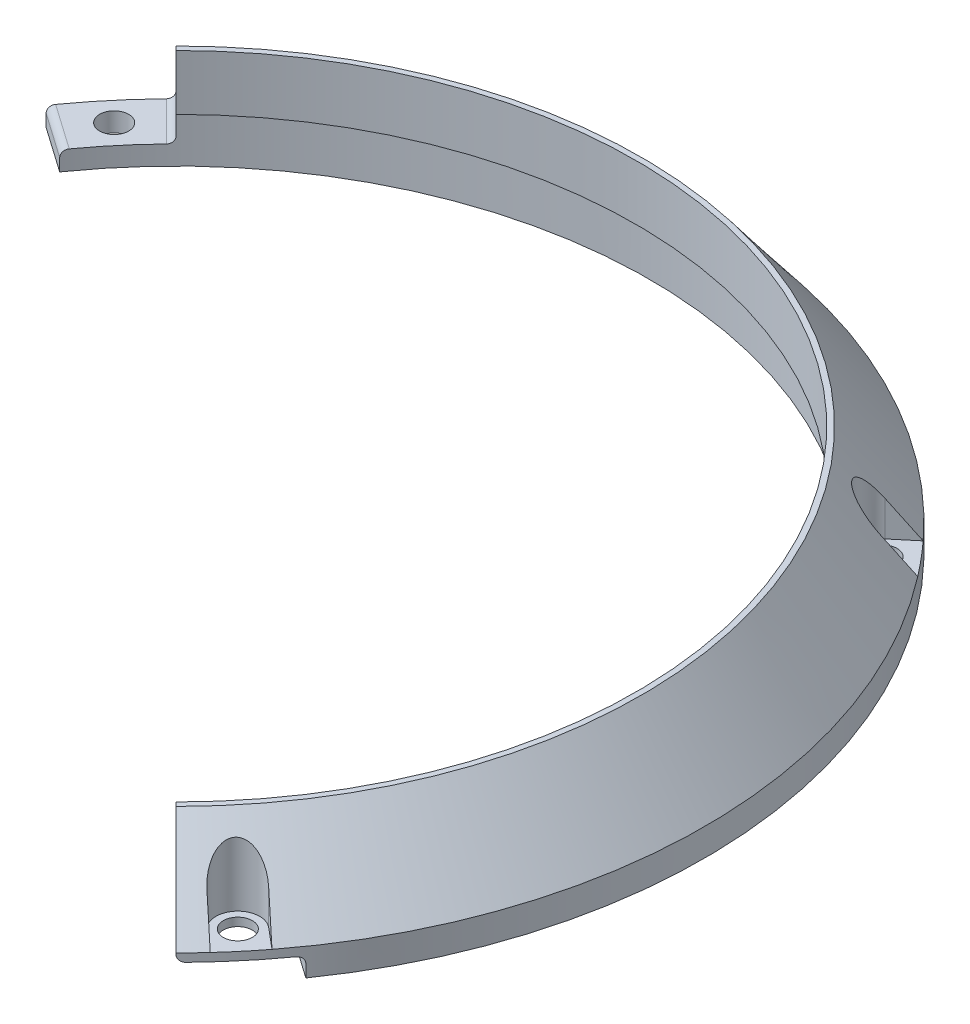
ISO-10303-21;
HEADER;
FILE_DESCRIPTION(('STEP AP214'),'2;1');
FILE_NAME('part.step','',(''),(''),'','','');
FILE_SCHEMA(('AUTOMOTIVE_DESIGN { 1 0 10303 214 1 1 1 1 }'));
ENDSEC;
DATA;
#1=APPLICATION_CONTEXT('core data for automotive mechanical design processes');
#2=APPLICATION_PROTOCOL_DEFINITION('international standard','automotive_design',2000,#1);
#3=PRODUCT_CONTEXT('',#1,'mechanical');
#4=PRODUCT('Part','Part','',(#3));
#5=PRODUCT_RELATED_PRODUCT_CATEGORY('part','',(#4));
#6=PRODUCT_DEFINITION_FORMATION('','',#4);
#7=PRODUCT_DEFINITION_CONTEXT('part definition',#1,'design');
#8=PRODUCT_DEFINITION('design','',#6,#7);
#9=PRODUCT_DEFINITION_SHAPE('','',#8);
#10=(LENGTH_UNIT() NAMED_UNIT(*) SI_UNIT(.MILLI.,.METRE.));
#11=(NAMED_UNIT(*) PLANE_ANGLE_UNIT() SI_UNIT($,.RADIAN.));
#12=(NAMED_UNIT(*) SI_UNIT($,.STERADIAN.) SOLID_ANGLE_UNIT());
#13=UNCERTAINTY_MEASURE_WITH_UNIT(LENGTH_MEASURE(1.E-05),#10,'distance_accuracy_value','');
#14=(GEOMETRIC_REPRESENTATION_CONTEXT(3) GLOBAL_UNCERTAINTY_ASSIGNED_CONTEXT((#13)) GLOBAL_UNIT_ASSIGNED_CONTEXT((#10,
#11,#12)) REPRESENTATION_CONTEXT('',''));
#15=CARTESIAN_POINT('',(0.,0.,0.));
#16=DIRECTION('',(0.,0.,1.));
#17=DIRECTION('',(1.,0.,0.));
#18=AXIS2_PLACEMENT_3D('',#15,#16,#17);
#19=CARTESIAN_POINT('',(-86.7043728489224,18.9797918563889,-86.7043728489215));
#20=DIRECTION('',(-0.707106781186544,0.,0.707106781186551));
#21=DIRECTION('',(0.707106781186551,0.,0.707106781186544));
#22=AXIS2_PLACEMENT_3D('',#19,#20,#21);
#23=PLANE('',#22);
#24=DIRECTION('',(0.,-1.,0.));
#25=VECTOR('',#24,1.);
#26=CARTESIAN_POINT('',(-86.7043728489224,18.9797918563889,-86.7043728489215));
#27=LINE('',#26,#25);
#28=CARTESIAN_POINT('',(-86.7043728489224,-0.070208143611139,-86.7043728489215));
#29=VERTEX_POINT('',#28);
#30=CARTESIAN_POINT('',(-86.7043728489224,-0.387708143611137,-86.7043728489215));
#31=VERTEX_POINT('',#30);
#32=EDGE_CURVE('E297',#29,#31,#27,.T.);
#33=ORIENTED_EDGE('',*,*,#32,.T.);
#34=DIRECTION('',(-0.707106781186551,0.,-0.707106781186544));
#35=VECTOR('',#34,1.);
#36=CARTESIAN_POINT('',(-86.7043728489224,-0.387708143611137,-86.7043728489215));
#37=LINE('',#36,#35);
#38=CARTESIAN_POINT('',(-77.6343141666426,-0.387708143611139,-77.6343141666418));
#39=VERTEX_POINT('',#38);
#40=EDGE_CURVE('E435',#31,#39,#37,.F.);
#41=ORIENTED_EDGE('',*,*,#40,.T.);
#42=DIRECTION('',(0.,-1.,0.));
#43=VECTOR('',#42,1.);
#44=CARTESIAN_POINT('',(-77.6343141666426,0.,-77.6343141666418));
#45=LINE('',#44,#43);
#46=CARTESIAN_POINT('',(-77.6343141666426,6.15279185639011,-77.6343141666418));
#47=VERTEX_POINT('',#46);
#48=EDGE_CURVE('E511',#39,#47,#45,.F.);
#49=ORIENTED_EDGE('',*,*,#48,.T.);
#50=DIRECTION('',(0.707106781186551,0.,0.707106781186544));
#51=VECTOR('',#50,1.);
#52=CARTESIAN_POINT('',(-54.8957500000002,6.15279185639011,-54.8957499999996));
#53=LINE('',#52,#51);
#54=CARTESIAN_POINT('',(-75.4431316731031,6.15279185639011,-75.4431316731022));
#55=VERTEX_POINT('',#54);
#56=EDGE_CURVE('E307',#47,#55,#53,.T.);
#57=ORIENTED_EDGE('',*,*,#56,.T.);
#58=DIRECTION('',(0.,-1.,0.));
#59=VECTOR('',#58,1.);
#60=CARTESIAN_POINT('',(-75.4431316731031,0.,-75.4431316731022));
#61=LINE('',#60,#59);
#62=CARTESIAN_POINT('',(-75.4431316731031,18.9797918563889,-75.4431316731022));
#63=VERTEX_POINT('',#62);
#64=EDGE_CURVE('E310',#55,#63,#61,.F.);
#65=ORIENTED_EDGE('',*,*,#64,.T.);
#66=DIRECTION('',(-0.707106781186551,0.,-0.707106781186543));
#67=VECTOR('',#66,1.);
#68=CARTESIAN_POINT('',(-86.7043728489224,18.9797918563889,-86.7043728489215));
#69=LINE('',#68,#67);
#70=CARTESIAN_POINT('',(-76.34115728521,18.9797918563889,-76.3411572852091));
#71=VERTEX_POINT('',#70);
#72=EDGE_CURVE('E293',#63,#71,#69,.T.);
#73=ORIENTED_EDGE('',*,*,#72,.T.);
#74=DIRECTION('',(-0.431166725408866,-0.792584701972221,-0.431166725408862));
#75=VECTOR('',#74,1.);
#76=CARTESIAN_POINT('',(0.,159.312590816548,0.));
#77=LINE('',#76,#75);
#78=EDGE_CURVE('E316',#71,#29,#77,.T.);
#79=ORIENTED_EDGE('',*,*,#78,.T.);
#80=EDGE_LOOP('',(#33,#41,#49,#57,#65,#73,#79));
#81=FACE_BOUND('',#80,.T.);
#82=ADVANCED_FACE('F44',(#81),#23,.T.);
#83=CARTESIAN_POINT('',(0.,18.9797918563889,0.));
#84=DIRECTION('',(0.,-1.,0.));
#85=DIRECTION('',(0.,0.,-1.));
#86=AXIS2_PLACEMENT_3D('',#83,#84,#85);
#87=CONICAL_SURFACE('',#86,107.962700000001,0.655760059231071);
#88=ORIENTED_EDGE('',*,*,#78,.F.);
#89=CARTESIAN_POINT('',(0.,18.9797918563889,0.));
#90=DIRECTION('',(0.,-1.,0.));
#91=DIRECTION('',(0.,0.,-1.));
#92=AXIS2_PLACEMENT_3D('',#89,#90,#91);
#93=CIRCLE('',#92,107.962700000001);
#94=CARTESIAN_POINT('',(76.3411572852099,18.9797918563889,76.3411572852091));
#95=VERTEX_POINT('',#94);
#96=EDGE_CURVE('E364',#71,#95,#93,.T.);
#97=ORIENTED_EDGE('',*,*,#96,.T.);
#98=DIRECTION('',(-0.431166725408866,0.792584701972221,-0.431166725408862));
#99=VECTOR('',#98,1.);
#100=CARTESIAN_POINT('',(0.,159.312590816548,0.));
#101=LINE('',#100,#99);
#102=CARTESIAN_POINT('',(86.7043728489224,-0.070208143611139,86.7043728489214));
#103=VERTEX_POINT('',#102);
#104=EDGE_CURVE('E313',#103,#95,#101,.T.);
#105=ORIENTED_EDGE('',*,*,#104,.F.);
#106=CARTESIAN_POINT('',(0.,-0.0702081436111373,0.));
#107=DIRECTION('',(0.,-1.,0.));
#108=DIRECTION('',(0.,0.,-1.));
#109=AXIS2_PLACEMENT_3D('',#106,#107,#108);
#110=CIRCLE('',#109,122.618499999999);
#111=CARTESIAN_POINT('',(90.5852136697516,-0.0702081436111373,82.6414884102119));
#112=VERTEX_POINT('',#111);
#113=EDGE_CURVE('E257',#112,#103,#110,.T.);
#114=ORIENTED_EDGE('',*,*,#113,.F.);
#115=CARTESIAN_POINT('',(85.8012772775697,8.03984749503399,78.6272891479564));
#116=CARTESIAN_POINT('',(86.5986433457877,6.68816201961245,79.2963587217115));
#117=CARTESIAN_POINT('',(87.3959975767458,5.33646464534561,79.965418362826));
#118=CARTESIAN_POINT('',(88.9906823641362,2.63304609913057,81.3035177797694));
#119=CARTESIAN_POINT('',(89.7880129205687,1.28132492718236,81.9725575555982));
#120=CARTESIAN_POINT('',(90.5853316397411,-0.0704081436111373,82.6415873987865));
#121=B_SPLINE_CURVE_WITH_KNOTS('',3,(#115,#116,#117,#118,#119,#120),.UNSPECIFIED.,.F.,.F.,(4,2,
4),(0.,5.11805659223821,10.2361131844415),.UNSPECIFIED.);
#122=CARTESIAN_POINT('',(85.8014772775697,8.03950845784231,78.6274569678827));
#123=VERTEX_POINT('',#122);
#124=EDGE_CURVE('E524',#123,#112,#121,.T.);
#125=ORIENTED_EDGE('',*,*,#124,.F.);
#126=CARTESIAN_POINT('',(92.3323993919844,8.03916941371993,70.8446132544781));
#127=CARTESIAN_POINT('',(92.2449132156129,8.18746992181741,70.7712084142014));
#128=CARTESIAN_POINT('',(92.1550450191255,8.33585166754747,70.7008075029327));
#129=CARTESIAN_POINT('',(91.9706674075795,8.6325386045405,70.5661508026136));
#130=CARTESIAN_POINT('',(91.8761576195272,8.78084378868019,70.5018955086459));
#131=CARTESIAN_POINT('',(91.6823834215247,9.07749788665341,70.3795210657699));
#132=CARTESIAN_POINT('',(91.5831073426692,9.22584592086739,70.3214182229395));
#133=CARTESIAN_POINT('',(91.3801321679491,9.52191193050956,70.2117525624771));
#134=CARTESIAN_POINT('',(91.2764331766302,9.66962992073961,70.1601895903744));
#135=CARTESIAN_POINT('',(90.956334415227,10.1148578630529,70.0145477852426));
#136=CARTESIAN_POINT('',(90.7331576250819,10.4110262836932,69.9309322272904));
#137=CARTESIAN_POINT('',(90.2695396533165,10.9964437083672,69.794467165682));
#138=CARTESIAN_POINT('',(90.0291209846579,11.285701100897,69.7415783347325));
#139=CARTESIAN_POINT('',(89.6559976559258,11.7109536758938,69.6886789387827));
#140=CARTESIAN_POINT('',(89.5297518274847,11.8510491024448,69.6754515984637));
#141=CARTESIAN_POINT('',(89.2729615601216,12.1278738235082,69.6585027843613));
#142=CARTESIAN_POINT('',(89.1424172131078,12.2646031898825,69.6547811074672));
#143=CARTESIAN_POINT('',(88.8773852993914,12.5335144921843,69.6577594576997));
#144=CARTESIAN_POINT('',(88.7429068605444,12.6657056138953,69.6644369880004));
#145=CARTESIAN_POINT('',(88.4698836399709,12.9247036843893,69.6892852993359));
#146=CARTESIAN_POINT('',(88.3313397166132,13.0515117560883,69.7074536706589));
#147=CARTESIAN_POINT('',(88.0817367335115,13.2707804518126,69.751150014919));
#148=CARTESIAN_POINT('',(87.9714323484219,13.364598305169,69.7741359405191));
#149=CARTESIAN_POINT('',(87.7487641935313,13.5471900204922,69.8285864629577));
#150=CARTESIAN_POINT('',(87.6363999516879,13.6359627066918,69.8600530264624));
#151=CARTESIAN_POINT('',(87.2970311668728,13.8928542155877,69.9682996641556));
#152=CARTESIAN_POINT('',(87.0671804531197,14.0520553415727,70.0590175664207));
#153=CARTESIAN_POINT('',(86.6773074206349,14.290563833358,70.2495358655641));
#154=CARTESIAN_POINT('',(86.5175938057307,14.3793731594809,70.337922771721));
#155=CARTESIAN_POINT('',(86.2803499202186,14.4955804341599,70.4873472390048));
#156=CARTESIAN_POINT('',(86.2016424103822,14.5314866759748,70.539973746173));
#157=CARTESIAN_POINT('',(86.0456104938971,14.5969438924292,70.6508891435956));
#158=CARTESIAN_POINT('',(85.9682854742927,14.6264977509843,70.7091754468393));
#159=CARTESIAN_POINT('',(85.8148390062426,14.678891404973,70.8320215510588));
#160=CARTESIAN_POINT('',(85.7387408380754,14.7016520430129,70.8966444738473));
#161=CARTESIAN_POINT('',(85.5894962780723,14.7394011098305,71.0312806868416));
#162=CARTESIAN_POINT('',(85.5163483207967,14.7543937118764,71.101291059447));
#163=CARTESIAN_POINT('',(85.3738344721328,14.7761833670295,71.2461887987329));
#164=CARTESIAN_POINT('',(85.3044663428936,14.7829853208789,71.3210732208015));
#165=CARTESIAN_POINT('',(85.1702501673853,14.7881998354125,71.4750573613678));
#166=CARTESIAN_POINT('',(85.1054015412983,14.7866134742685,71.5541565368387));
#167=CARTESIAN_POINT('',(84.9900225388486,14.7759507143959,71.7038647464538));
#168=CARTESIAN_POINT('',(84.938787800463,14.7680081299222,71.7740153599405));
#169=CARTESIAN_POINT('',(84.8403672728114,14.7462397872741,71.9162290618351));
#170=CARTESIAN_POINT('',(84.7931826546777,14.7324123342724,71.9882926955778));
#171=CARTESIAN_POINT('',(84.6580386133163,14.6825000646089,72.2065074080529));
#172=CARTESIAN_POINT('',(84.5764342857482,14.63797983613,72.3547537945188));
#173=CARTESIAN_POINT('',(84.4096440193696,14.5139563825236,72.6956808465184));
#174=CARTESIAN_POINT('',(84.330245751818,14.4280599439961,72.8888146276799));
#175=CARTESIAN_POINT('',(84.1982046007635,14.2316354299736,73.2717092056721));
#176=CARTESIAN_POINT('',(84.1456118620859,14.1210617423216,73.4614630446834));
#177=CARTESIAN_POINT('',(84.0744466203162,13.9127630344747,73.7859834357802));
#178=CARTESIAN_POINT('',(84.0505955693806,13.8190968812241,73.9222927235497));
#179=CARTESIAN_POINT('',(84.0143690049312,13.6237535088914,74.1906995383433));
#180=CARTESIAN_POINT('',(84.0019990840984,13.5220724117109,74.3227949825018));
#181=CARTESIAN_POINT('',(83.9874854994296,13.3122130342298,74.5825679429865));
#182=CARTESIAN_POINT('',(83.9853570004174,13.2040253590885,74.7102386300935));
#183=CARTESIAN_POINT('',(83.9902730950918,12.9825145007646,74.9608867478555));
#184=CARTESIAN_POINT('',(83.9973207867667,12.8691895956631,75.0838625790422));
#185=CARTESIAN_POINT('',(84.02651756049,12.5675778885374,75.3991415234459));
#186=CARTESIAN_POINT('',(84.0552801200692,12.3759693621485,75.5876732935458));
#187=CARTESIAN_POINT('',(84.131187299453,11.9850520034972,75.9527136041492));
#188=CARTESIAN_POINT('',(84.1783434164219,11.7857384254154,76.1292145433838));
#189=CARTESIAN_POINT('',(84.2888783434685,11.3811531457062,76.4708262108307));
#190=CARTESIAN_POINT('',(84.3522941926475,11.1758688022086,76.635909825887));
#191=CARTESIAN_POINT('',(84.4935514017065,10.7614235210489,76.9544624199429));
#192=CARTESIAN_POINT('',(84.5713892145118,10.5522635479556,77.107934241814));
#193=CARTESIAN_POINT('',(84.7320384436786,10.1516103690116,77.3891621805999));
#194=CARTESIAN_POINT('',(84.8136400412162,9.96036577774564,77.5179697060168));
#195=CARTESIAN_POINT('',(84.9868507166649,9.57638627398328,77.766299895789));
#196=CARTESIAN_POINT('',(85.078460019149,9.38365132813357,77.8858223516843));
#197=CARTESIAN_POINT('',(85.270272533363,8.99903502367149,78.1144984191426));
#198=CARTESIAN_POINT('',(85.3703930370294,8.80716107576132,78.2237340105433));
#199=CARTESIAN_POINT('',(85.5794996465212,8.42317898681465,78.432794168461));
#200=CARTESIAN_POINT('',(85.6884839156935,8.23107090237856,78.5326206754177));
#201=CARTESIAN_POINT('',(85.8017156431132,8.0391043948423,78.6276569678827));
#202=B_SPLINE_CURVE_WITH_KNOTS('',3,(#126,#127,#128,#129,#130,#131,#132,#133,#134,#135,#136,
#137,#138,#139,#140,#141,#142,#143,#144,#145,#146,#147,#148,#149,#150,#151,#152,#153,#154,#155,
#156,#157,#158,#159,#160,#161,#162,#163,#164,#165,#166,#167,#168,#169,#170,#171,#172,#173,#174,
#175,#176,#177,#178,#179,#180,#181,#182,#183,#184,#185,#186,#187,#188,#189,#190,#191,#192,#193,
#194,#195,#196,#197,#198,#199,#200,#201),.UNSPECIFIED.,.F.,.F.,(4,2,2,2,2,2,2,2,2,2,2,2,2,2,2,2,
2,2,2,2,2,2,2,2,2,2,2,2,2,2,2,2,2,2,2,2,2,4),(0.,0.561489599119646,1.12302439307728,
1.6860120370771,2.24898638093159,3.38783748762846,4.52522774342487,5.09211816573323,
5.65899647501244,6.22465014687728,6.79018523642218,7.22970253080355,7.66932183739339,
8.54627164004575,9.15298298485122,9.45644802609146,9.75977500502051,10.0665096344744,
10.3730793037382,10.6794654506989,10.9858122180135,11.2471838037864,11.5086307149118,
12.0312573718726,12.705008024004,13.3800144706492,13.8806618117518,14.3815529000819,
14.8831854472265,15.3849873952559,16.1947537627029,17.00502709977,17.8171628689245,
18.6290991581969,19.362479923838,20.0958771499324,20.8228213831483,21.5496153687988),.UNSPECIFIED.);
#203=CARTESIAN_POINT('',(92.3321993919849,8.0395084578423,70.8444454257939));
#204=VERTEX_POINT('',#203);
#205=EDGE_CURVE('E552',#204,#123,#202,.T.);
#206=ORIENTED_EDGE('',*,*,#205,.F.);
#207=CARTESIAN_POINT('',(97.1160537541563,-0.0704081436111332,74.8585758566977));
#208=CARTESIAN_POINT('',(96.3187350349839,1.28132492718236,74.1895460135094));
#209=CARTESIAN_POINT('',(95.5214044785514,2.63304609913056,73.5205062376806));
#210=CARTESIAN_POINT('',(93.926719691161,5.3364646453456,72.1824068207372));
#211=CARTESIAN_POINT('',(93.129365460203,6.68816201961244,71.5133471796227));
#212=CARTESIAN_POINT('',(92.3319993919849,8.03984749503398,70.8442776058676));
#213=B_SPLINE_CURVE_WITH_KNOTS('',3,(#207,#208,#209,#210,#211,#212),.UNSPECIFIED.,.F.,.F.,(4,2,
4),(0.,5.11805659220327,10.2361131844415),.UNSPECIFIED.);
#214=CARTESIAN_POINT('',(97.1159357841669,-0.0702081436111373,74.8584768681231));
#215=VERTEX_POINT('',#214);
#216=EDGE_CURVE('E532',#215,#204,#213,.T.);
#217=ORIENTED_EDGE('',*,*,#216,.F.);
#218=CARTESIAN_POINT('',(97.1159357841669,-0.0702081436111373,-74.8584768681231));
#219=VERTEX_POINT('',#218);
#220=EDGE_CURVE('E579',#219,#215,#110,.T.);
#221=ORIENTED_EDGE('',*,*,#220,.F.);
#222=CARTESIAN_POINT('',(92.3319993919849,8.03984749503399,-70.8442776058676));
#223=CARTESIAN_POINT('',(93.129365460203,6.68816201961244,-71.5133471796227));
#224=CARTESIAN_POINT('',(93.926719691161,5.3364646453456,-72.1824068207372));
#225=CARTESIAN_POINT('',(95.5214044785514,2.63304609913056,-73.5205062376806));
#226=CARTESIAN_POINT('',(96.3187350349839,1.28132492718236,-74.1895460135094));
#227=CARTESIAN_POINT('',(97.1160537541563,-0.0704081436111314,-74.8585758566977));
#228=B_SPLINE_CURVE_WITH_KNOTS('',3,(#222,#223,#224,#225,#226,#227),.UNSPECIFIED.,.F.,.F.,(4,2,
4),(0.,5.1180565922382,10.2361131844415),.UNSPECIFIED.);
#229=CARTESIAN_POINT('',(92.3321993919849,8.0395084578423,-70.8444454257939));
#230=VERTEX_POINT('',#229);
#231=EDGE_CURVE('E557',#230,#219,#228,.T.);
#232=ORIENTED_EDGE('',*,*,#231,.F.);
#233=CARTESIAN_POINT('',(85.8017156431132,8.0391043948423,-78.6276569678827));
#234=CARTESIAN_POINT('',(85.7142332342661,8.18740520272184,-78.5542472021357));
#235=CARTESIAN_POINT('',(85.6292954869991,8.33578726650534,-78.4779699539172));
#236=CARTESIAN_POINT('',(85.4646658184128,8.6324748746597,-78.3197776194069));
#237=CARTESIAN_POINT('',(85.3849743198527,8.78078041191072,-78.2378620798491));
#238=CARTESIAN_POINT('',(85.230808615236,9.07743523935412,-78.0682830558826));
#239=CARTESIAN_POINT('',(85.1563484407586,9.2257836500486,-77.9806052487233));
#240=CARTESIAN_POINT('',(85.0131007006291,9.52185044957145,-77.7997581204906));
#241=CARTESIAN_POINT('',(84.9443130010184,9.66956885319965,-77.7065889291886));
#242=CARTESIAN_POINT('',(84.7452963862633,10.1147980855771,-77.4166452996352));
#243=CARTESIAN_POINT('',(84.6241949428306,10.4109674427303,-77.2113798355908));
#244=CARTESIAN_POINT('',(84.4092926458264,10.9963869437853,-76.7785042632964));
#245=CARTESIAN_POINT('',(84.3154569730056,11.2856454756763,-76.550923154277));
#246=CARTESIAN_POINT('',(84.1985653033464,11.7109016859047,-76.192654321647));
#247=CARTESIAN_POINT('',(84.1636150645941,11.8509994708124,-76.0706223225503));
#248=CARTESIAN_POINT('',(84.1023297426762,12.1278289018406,-75.8206741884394));
#249=CARTESIAN_POINT('',(84.0759944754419,12.2645606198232,-75.6927581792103));
#250=CARTESIAN_POINT('',(84.0329027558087,12.5334765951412,-75.4312329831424));
#251=CARTESIAN_POINT('',(84.0161257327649,12.665670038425,-75.2976366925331));
#252=CARTESIAN_POINT('',(83.9931844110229,12.9246727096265,-75.0244435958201));
#253=CARTESIAN_POINT('',(83.9870178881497,13.051483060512,-74.8848480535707));
#254=CARTESIAN_POINT('',(83.9867057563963,13.270754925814,-74.6314474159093));
#255=CARTESIAN_POINT('',(83.9901876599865,13.3645737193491,-74.5188270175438));
#256=CARTESIAN_POINT('',(84.0051437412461,13.547167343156,-74.2900857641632));
#257=CARTESIAN_POINT('',(84.0166197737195,13.6359409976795,-74.1739641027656));
#258=CARTESIAN_POINT('',(84.0642892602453,13.8928354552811,-73.8209530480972));
#259=CARTESIAN_POINT('',(84.1137146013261,14.0520386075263,-73.5788403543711));
#260=CARTESIAN_POINT('',(84.2336359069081,14.2905505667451,-73.161805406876));
#261=CARTESIAN_POINT('',(84.2929453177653,14.379361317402,-72.9891691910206));
#262=CARTESIAN_POINT('',(84.3989017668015,14.4955707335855,-72.7295809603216));
#263=CARTESIAN_POINT('',(84.4370610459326,14.5314776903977,-72.6429302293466));
#264=CARTESIAN_POINT('',(84.5191961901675,14.5969363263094,-72.47000754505));
#265=CARTESIAN_POINT('',(84.5631694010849,14.6264908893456,-72.3837354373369));
#266=CARTESIAN_POINT('',(84.6575030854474,14.678885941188,-72.2112870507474));
#267=CARTESIAN_POINT('',(84.7079297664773,14.7016472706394,-72.1251227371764));
#268=CARTESIAN_POINT('',(84.8146042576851,14.7393976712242,-71.95476497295));
#269=CARTESIAN_POINT('',(84.8708489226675,14.7543909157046,-71.8705704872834));
#270=CARTESIAN_POINT('',(84.988797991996,14.7761817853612,-71.7050592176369));
#271=CARTESIAN_POINT('',(85.0504991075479,14.7829843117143,-71.6237407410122));
#272=CARTESIAN_POINT('',(85.1788375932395,14.7881998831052,-71.4648232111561));
#273=CARTESIAN_POINT('',(85.2454743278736,14.7866140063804,-71.3872236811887));
#274=CARTESIAN_POINT('',(85.3728728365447,14.7759520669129,-71.2475999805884));
#275=CARTESIAN_POINT('',(85.433060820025,14.7680098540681,-71.1849617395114));
#276=CARTESIAN_POINT('',(85.5560233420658,14.7462422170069,-71.0633405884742));
#277=CARTESIAN_POINT('',(85.6187986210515,14.7324150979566,-71.0043587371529));
#278=CARTESIAN_POINT('',(85.8102306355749,14.6825037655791,-70.8333741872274));
#279=CARTESIAN_POINT('',(85.9420544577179,14.637984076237,-70.7272661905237));
#280=CARTESIAN_POINT('',(86.2488384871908,14.5139620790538,-70.503807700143));
#281=CARTESIAN_POINT('',(86.4252499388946,14.4280666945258,-70.392078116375));
#282=CARTESIAN_POINT('',(86.7793972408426,14.2316443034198,-70.1955534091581));
#283=CARTESIAN_POINT('',(86.9571349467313,14.1210716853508,-70.1108088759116));
#284=CARTESIAN_POINT('',(87.2643660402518,13.9127749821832,-69.984371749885));
#285=CARTESIAN_POINT('',(87.3944620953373,13.8191097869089,-69.9372129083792));
#286=CARTESIAN_POINT('',(87.6524991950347,13.6237683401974,-69.8549277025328));
#287=CARTESIAN_POINT('',(87.7804391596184,13.5220882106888,-69.8198072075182));
#288=CARTESIAN_POINT('',(88.0337441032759,13.3122307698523,-69.760404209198));
#289=CARTESIAN_POINT('',(88.1591049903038,13.2040440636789,-69.7361378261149));
#290=CARTESIAN_POINT('',(88.4067977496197,12.9825351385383,-69.6974537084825));
#291=CARTESIAN_POINT('',(88.5291285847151,12.8692111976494,-69.6830393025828));
#292=CARTESIAN_POINT('',(88.8446863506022,12.5676020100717,-69.6570435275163));
#293=CARTESIAN_POINT('',(89.0353476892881,12.3759950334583,-69.6526300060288));
#294=CARTESIAN_POINT('',(89.4080219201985,11.9850807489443,-69.6639934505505));
#295=CARTESIAN_POINT('',(89.5900293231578,11.7857686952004,-69.6797830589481));
#296=CARTESIAN_POINT('',(89.9456441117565,11.3811864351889,-69.7293162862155));
#297=CARTESIAN_POINT('',(90.1192312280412,11.1759035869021,-69.7631010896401));
#298=CARTESIAN_POINT('',(90.4574723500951,10.7614612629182,-69.8468938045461));
#299=CARTESIAN_POINT('',(90.6221285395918,10.5523027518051,-69.896897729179));
#300=CARTESIAN_POINT('',(90.9269790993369,10.1516531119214,-70.0062689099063));
#301=CARTESIAN_POINT('',(91.0679988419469,9.96041061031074,-70.0642621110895));
#302=CARTESIAN_POINT('',(91.342632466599,9.57643526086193,-70.1917160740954));
#303=CARTESIAN_POINT('',(91.4762461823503,9.38370237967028,-70.2611770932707));
#304=CARTESIAN_POINT('',(91.734754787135,8.99909015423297,-70.4103628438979));
#305=CARTESIAN_POINT('',(91.8597160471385,8.80721822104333,-70.4899918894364));
#306=CARTESIAN_POINT('',(92.1019101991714,8.42324011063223,-70.6596149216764));
#307=CARTESIAN_POINT('',(92.2191446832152,8.23113399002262,-70.7496067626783));
#308=CARTESIAN_POINT('',(92.3323993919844,8.03916941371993,-70.8446132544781));
#309=B_SPLINE_CURVE_WITH_KNOTS('',3,(#233,#234,#235,#236,#237,#238,#239,#240,#241,#242,#243,
#244,#245,#246,#247,#248,#249,#250,#251,#252,#253,#254,#255,#256,#257,#258,#259,#260,#261,#262,
#263,#264,#265,#266,#267,#268,#269,#270,#271,#272,#273,#274,#275,#276,#277,#278,#279,#280,#281,
#282,#283,#284,#285,#286,#287,#288,#289,#290,#291,#292,#293,#294,#295,#296,#297,#298,#299,#300,
#301,#302,#303,#304,#305,#306,#307,#308),.UNSPECIFIED.,.F.,.F.,(4,2,2,2,2,2,2,2,2,2,2,2,2,2,2,2,
2,2,2,2,2,2,2,2,2,2,2,2,2,2,2,2,2,2,2,2,2,4),(0.,0.56149082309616,1.12302683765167,
1.68601565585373,2.24899117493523,3.38784459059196,4.52523719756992,5.09213568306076,
5.65902205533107,6.22468375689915,6.79022686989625,7.2297466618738,7.66936846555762,
8.54632326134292,9.15303784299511,9.45650450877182,9.75983311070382,10.0665694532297,
10.3731408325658,10.6795286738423,10.9858771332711,11.2472492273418,11.5086966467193,
12.0313243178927,12.7050721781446,13.3800758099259,13.8807201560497,14.3816082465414,
14.8832377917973,15.3850367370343,16.1947982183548,17.0050666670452,17.8171975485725,
18.6291289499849,19.3625022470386,20.0958920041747,20.8228288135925,21.5496153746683),.UNSPECIFIED.);
#310=CARTESIAN_POINT('',(85.8014772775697,8.03950845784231,-78.6274569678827));
#311=VERTEX_POINT('',#310);
#312=EDGE_CURVE('E377',#311,#230,#309,.T.);
#313=ORIENTED_EDGE('',*,*,#312,.F.);
#314=CARTESIAN_POINT('',(90.5853316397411,-0.070408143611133,-82.6415873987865));
#315=CARTESIAN_POINT('',(89.7880129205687,1.28132492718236,-81.9725575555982));
#316=CARTESIAN_POINT('',(88.9906823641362,2.63304609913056,-81.3035177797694));
#317=CARTESIAN_POINT('',(87.3959975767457,5.3364646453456,-79.965418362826));
#318=CARTESIAN_POINT('',(86.5986433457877,6.68816201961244,-79.2963587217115));
#319=CARTESIAN_POINT('',(85.8012772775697,8.03984749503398,-78.6272891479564));
#320=B_SPLINE_CURVE_WITH_KNOTS('',3,(#314,#315,#316,#317,#318,#319),.UNSPECIFIED.,.F.,.F.,(4,2,
4),(0.,5.11805659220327,10.2361131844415),.UNSPECIFIED.);
#321=CARTESIAN_POINT('',(90.5852136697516,-0.0702081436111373,-82.6414884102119));
#322=VERTEX_POINT('',#321);
#323=EDGE_CURVE('E385',#322,#311,#320,.T.);
#324=ORIENTED_EDGE('',*,*,#323,.F.);
#325=EDGE_CURVE('E361',#29,#322,#110,.T.);
#326=ORIENTED_EDGE('',*,*,#325,.F.);
#327=EDGE_LOOP('',(#88,#97,#105,#114,#125,#206,#217,#221,#232,#313,#324,#326));
#328=FACE_BOUND('',#327,.T.);
#329=ADVANCED_FACE('F391',(#328),#87,.T.);
#330=CARTESIAN_POINT('',(-109.791499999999,6.15279185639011,0.));
#331=DIRECTION('',(0.,1.,0.));
#332=DIRECTION('',(0.,0.,1.));
#333=AXIS2_PLACEMENT_3D('',#330,#331,#332);
#334=PLANE('',#333);
#335=ORIENTED_EDGE('',*,*,#56,.F.);
#336=CARTESIAN_POINT('',(0.,6.15279185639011,0.));
#337=DIRECTION('',(0.,-1.,0.));
#338=DIRECTION('',(0.,0.,-1.));
#339=AXIS2_PLACEMENT_3D('',#336,#337,#338);
#340=CIRCLE('',#339,109.791499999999);
#341=CARTESIAN_POINT('',(77.6343141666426,6.15279185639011,77.6343141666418));
#342=VERTEX_POINT('',#341);
#343=EDGE_CURVE('E346',#47,#342,#340,.T.);
#344=ORIENTED_EDGE('',*,*,#343,.T.);
#345=CARTESIAN_POINT('',(75.4431316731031,6.15279185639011,75.4431316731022));
#346=VERTEX_POINT('',#345);
#347=EDGE_CURVE('E303',#346,#342,#53,.T.);
#348=ORIENTED_EDGE('',*,*,#347,.F.);
#349=CARTESIAN_POINT('',(0.,6.15279185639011,0.));
#350=DIRECTION('',(0.,-1.,0.));
#351=DIRECTION('',(0.,0.,-1.));
#352=AXIS2_PLACEMENT_3D('',#349,#350,#351);
#353=CIRCLE('',#352,106.692700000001);
#354=EDGE_CURVE('E373',#55,#346,#353,.T.);
#355=ORIENTED_EDGE('',*,*,#354,.F.);
#356=EDGE_LOOP('',(#335,#344,#348,#355));
#357=FACE_BOUND('',#356,.T.);
#358=ADVANCED_FACE('F600',(#357),#334,.F.);
#359=CARTESIAN_POINT('',(0.,0.,0.));
#360=DIRECTION('',(0.,-1.,0.));
#361=DIRECTION('',(0.,0.,-1.));
#362=AXIS2_PLACEMENT_3D('',#359,#360,#361);
#363=CYLINDRICAL_SURFACE('',#362,106.692700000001);
#364=ORIENTED_EDGE('',*,*,#64,.F.);
#365=ORIENTED_EDGE('',*,*,#354,.T.);
#366=DIRECTION('',(0.,-1.,0.));
#367=VECTOR('',#366,1.);
#368=CARTESIAN_POINT('',(75.4431316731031,0.,75.4431316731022));
#369=LINE('',#368,#367);
#370=CARTESIAN_POINT('',(75.443131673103,18.9797918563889,75.4431316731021));
#371=VERTEX_POINT('',#370);
#372=EDGE_CURVE('E306',#371,#346,#369,.T.);
#373=ORIENTED_EDGE('',*,*,#372,.F.);
#374=CARTESIAN_POINT('',(0.,18.9797918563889,0.));
#375=DIRECTION('',(0.,-1.,0.));
#376=DIRECTION('',(0.,0.,-1.));
#377=AXIS2_PLACEMENT_3D('',#374,#375,#376);
#378=CIRCLE('',#377,106.692700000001);
#379=EDGE_CURVE('E369',#63,#371,#378,.T.);
#380=ORIENTED_EDGE('',*,*,#379,.F.);
#381=EDGE_LOOP('',(#364,#365,#373,#380));
#382=FACE_BOUND('',#381,.T.);
#383=ADVANCED_FACE('F603',(#382),#363,.F.);
#384=CARTESIAN_POINT('',(-106.692700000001,18.9797918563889,0.));
#385=DIRECTION('',(0.,-1.,0.));
#386=DIRECTION('',(0.,0.,-1.));
#387=AXIS2_PLACEMENT_3D('',#384,#385,#386);
#388=PLANE('',#387);
#389=EDGE_CURVE('E296',#95,#371,#69,.T.);
#390=ORIENTED_EDGE('',*,*,#389,.F.);
#391=ORIENTED_EDGE('',*,*,#96,.F.);
#392=ORIENTED_EDGE('',*,*,#72,.F.);
#393=ORIENTED_EDGE('',*,*,#379,.T.);
#394=EDGE_LOOP('',(#390,#391,#392,#393));
#395=FACE_BOUND('',#394,.T.);
#396=ADVANCED_FACE('F468',(#395),#388,.F.);
#397=CARTESIAN_POINT('',(0.,0.,0.));
#398=DIRECTION('',(0.,-1.,0.));
#399=DIRECTION('',(0.,0.,-1.));
#400=AXIS2_PLACEMENT_3D('',#397,#398,#399);
#401=CYLINDRICAL_SURFACE('',#400,122.618499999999);
#402=DIRECTION('',(0.,-1.,0.));
#403=VECTOR('',#402,1.);
#404=CARTESIAN_POINT('',(86.7043728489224,18.9797918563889,86.7043728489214));
#405=LINE('',#404,#403);
#406=CARTESIAN_POINT('',(86.7043728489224,-0.387708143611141,86.7043728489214));
#407=VERTEX_POINT('',#406);
#408=EDGE_CURVE('E300',#103,#407,#405,.T.);
#409=ORIENTED_EDGE('',*,*,#408,.T.);
#410=CARTESIAN_POINT('',(86.7043728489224,-0.38770814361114,86.7043728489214));
#411=CARTESIAN_POINT('',(86.7043729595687,-0.43237198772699,86.7043725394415));
#412=CARTESIAN_POINT('',(86.7057065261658,-0.477014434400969,86.7030391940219));
#413=CARTESIAN_POINT('',(86.7110260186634,-0.565979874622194,86.6977192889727));
#414=CARTESIAN_POINT('',(86.7150118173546,-0.610302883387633,86.6937328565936));
#415=CARTESIAN_POINT('',(86.7309084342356,-0.742239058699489,86.6778305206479));
#416=CARTESIAN_POINT('',(86.7467585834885,-0.828968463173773,86.6619714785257));
#417=CARTESIAN_POINT('',(86.788507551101,-0.997429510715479,86.6201614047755));
#418=CARTESIAN_POINT('',(86.8144111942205,-1.07915873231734,86.5942055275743));
#419=CARTESIAN_POINT('',(86.8755029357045,-1.23529836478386,86.5329151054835));
#420=CARTESIAN_POINT('',(86.910689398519,-1.30971006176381,86.4975822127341));
#421=CARTESIAN_POINT('',(86.989315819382,-1.44910204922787,86.4185082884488));
#422=CARTESIAN_POINT('',(87.0327556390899,-1.5140824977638,86.3747673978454));
#423=CARTESIAN_POINT('',(87.1266325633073,-1.63278532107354,86.2800722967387));
#424=CARTESIAN_POINT('',(87.177071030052,-1.68650549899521,86.2291166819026));
#425=CARTESIAN_POINT('',(87.2834741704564,-1.78115191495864,86.1214108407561));
#426=CARTESIAN_POINT('',(87.3394397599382,-1.8220760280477,86.0646596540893));
#427=CARTESIAN_POINT('',(87.4552654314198,-1.88994175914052,85.9469597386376));
#428=CARTESIAN_POINT('',(87.5151232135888,-1.91689155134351,85.8860134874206));
#429=CARTESIAN_POINT('',(87.6160652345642,-1.94934950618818,85.7830107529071));
#430=CARTESIAN_POINT('',(87.656552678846,-1.95904072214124,85.7416390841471));
#431=CARTESIAN_POINT('',(87.7379106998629,-1.97196919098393,85.6583853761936));
#432=CARTESIAN_POINT('',(87.7787806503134,-1.9752155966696,85.6165041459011));
#433=CARTESIAN_POINT('',(87.8196380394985,-1.97520814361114,85.5745740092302));
#434=B_SPLINE_CURVE_WITH_KNOTS('',3,(#410,#411,#412,#413,#414,#415,#416,#417,#418,#419,#420,
#421,#422,#423,#424,#425,#426,#427,#428,#429,#430,#431,#432,#433),.UNSPECIFIED.,.F.,.F.,(4,2,2,
2,2,2,2,2,2,2,2,4),(0.,0.133909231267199,0.267812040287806,0.535176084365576,0.802668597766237,
1.07011401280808,1.33755494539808,1.60504800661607,1.87258546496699,2.13996625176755,
2.31570851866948,2.49120102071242),.UNSPECIFIED.);
#435=CARTESIAN_POINT('',(87.8196380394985,-1.97520814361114,85.5745740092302));
#436=VERTEX_POINT('',#435);
#437=EDGE_CURVE('E460',#407,#436,#434,.T.);
#438=ORIENTED_EDGE('',*,*,#437,.T.);
#439=CARTESIAN_POINT('',(0.,-1.97520814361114,0.));
#440=DIRECTION('',(0.,-1.,0.));
#441=DIRECTION('',(0.,0.,-1.));
#442=AXIS2_PLACEMENT_3D('',#439,#440,#441);
#443=CIRCLE('',#442,122.618499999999);
#444=CARTESIAN_POINT('',(99.524224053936,-1.97520814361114,71.625591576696));
#445=VERTEX_POINT('',#444);
#446=EDGE_CURVE('E285',#445,#436,#443,.T.);
#447=ORIENTED_EDGE('',*,*,#446,.F.);
#448=CARTESIAN_POINT('',(99.524224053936,-1.97520814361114,71.625591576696));
#449=CARTESIAN_POINT('',(99.5503136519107,-1.97520844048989,71.5893401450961));
#450=CARTESIAN_POINT('',(99.5763707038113,-1.9770938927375,71.5530916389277));
#451=CARTESIAN_POINT('',(99.6282593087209,-1.9846158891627,71.4808258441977));
#452=CARTESIAN_POINT('',(99.6540908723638,-1.99025225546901,71.4448085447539));
#453=CARTESIAN_POINT('',(99.730925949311,-2.01273444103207,71.3375542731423));
#454=CARTESIAN_POINT('',(99.7813568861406,-2.03515349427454,71.2669939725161));
#455=CARTESIAN_POINT('',(99.8791747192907,-2.09423292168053,71.1298398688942));
#456=CARTESIAN_POINT('',(99.9265601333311,-2.13090017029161,71.0632479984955));
#457=CARTESIAN_POINT('',(100.016970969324,-2.21743174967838,70.9359440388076));
#458=CARTESIAN_POINT('',(100.059997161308,-2.26729374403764,70.8752309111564));
#459=CARTESIAN_POINT('',(100.140503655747,-2.37879778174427,70.7614368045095));
#460=CARTESIAN_POINT('',(100.177984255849,-2.44043919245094,70.7083554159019));
#461=CARTESIAN_POINT('',(100.246388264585,-2.5737706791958,70.611342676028));
#462=CARTESIAN_POINT('',(100.277310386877,-2.64546272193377,70.5674131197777));
#463=CARTESIAN_POINT('',(100.331753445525,-2.79685651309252,70.489985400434));
#464=CARTESIAN_POINT('',(100.355272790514,-2.87655997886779,70.456489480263));
#465=CARTESIAN_POINT('',(100.394257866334,-3.04169118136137,70.4009281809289));
#466=CARTESIAN_POINT('',(100.409728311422,-3.12711553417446,70.3788561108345));
#467=CARTESIAN_POINT('',(100.428357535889,-3.27133646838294,70.3522686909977));
#468=CARTESIAN_POINT('',(100.433918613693,-3.32922604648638,70.3443288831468));
#469=CARTESIAN_POINT('',(100.44133662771,-3.44563837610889,70.3337362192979));
#470=CARTESIAN_POINT('',(100.443198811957,-3.50416011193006,70.3310758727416));
#471=CARTESIAN_POINT('',(100.443194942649,-3.56270814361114,70.3310822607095));
#472=B_SPLINE_CURVE_WITH_KNOTS('',3,(#448,#449,#450,#451,#452,#453,#454,#455,#456,#457,#458,
#459,#460,#461,#462,#463,#464,#465,#466,#467,#468,#469,#470,#471),.UNSPECIFIED.,.F.,.F.,(4,2,2,
2,2,2,2,2,2,2,2,4),(0.,0.133908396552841,0.267810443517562,0.53517317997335,0.802665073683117,
1.07010963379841,1.33753983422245,1.60502243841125,1.87256250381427,2.13994569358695,
2.31569814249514,2.49120105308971),.UNSPECIFIED.);
#473=CARTESIAN_POINT('',(100.443194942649,-3.56270814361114,70.3310822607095));
#474=VERTEX_POINT('',#473);
#475=EDGE_CURVE('E434',#445,#474,#472,.T.);
#476=ORIENTED_EDGE('',*,*,#475,.T.);
#477=DIRECTION('',(0.,1.,0.));
#478=VECTOR('',#477,1.);
#479=CARTESIAN_POINT('',(100.443194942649,-1.97520814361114,70.3310822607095));
#480=LINE('',#479,#478);
#481=CARTESIAN_POINT('',(100.443194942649,-6.42020814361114,70.3310822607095));
#482=VERTEX_POINT('',#481);
#483=EDGE_CURVE('E253',#482,#474,#480,.T.);
#484=ORIENTED_EDGE('',*,*,#483,.F.);
#485=CARTESIAN_POINT('',(0.,-6.42020814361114,0.));
#486=DIRECTION('',(0.,-1.,0.));
#487=DIRECTION('',(0.,0.,-1.));
#488=AXIS2_PLACEMENT_3D('',#485,#486,#487);
#489=CIRCLE('',#488,122.618499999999);
#490=CARTESIAN_POINT('',(-100.443194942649,-6.42020814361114,-70.3310822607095));
#491=VERTEX_POINT('',#490);
#492=EDGE_CURVE('E249',#491,#482,#489,.T.);
#493=ORIENTED_EDGE('',*,*,#492,.F.);
#494=DIRECTION('',(0.,-1.,0.));
#495=VECTOR('',#494,1.);
#496=CARTESIAN_POINT('',(-100.443194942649,-6.42020814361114,-70.3310822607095));
#497=LINE('',#496,#495);
#498=CARTESIAN_POINT('',(-100.443194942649,-3.56270814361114,-70.3310822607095));
#499=VERTEX_POINT('',#498);
#500=EDGE_CURVE('E235',#499,#491,#497,.T.);
#501=ORIENTED_EDGE('',*,*,#500,.F.);
#502=CARTESIAN_POINT('',(-100.443194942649,-3.56270814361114,-70.3310822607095));
#503=CARTESIAN_POINT('',(-100.443194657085,-3.51804429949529,-70.3310824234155));
#504=CARTESIAN_POINT('',(-100.442113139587,-3.47340185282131,-70.3326272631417));
#505=CARTESIAN_POINT('',(-100.437797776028,-3.38443641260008,-70.3387897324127));
#506=CARTESIAN_POINT('',(-100.434564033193,-3.34011340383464,-70.3434072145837));
#507=CARTESIAN_POINT('',(-100.421663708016,-3.20817722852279,-70.3618237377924));
#508=CARTESIAN_POINT('',(-100.408797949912,-3.12144782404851,-70.3801869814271));
#509=CARTESIAN_POINT('',(-100.374872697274,-2.95298677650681,-70.4285619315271));
#510=CARTESIAN_POINT('',(-100.353809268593,-2.87125755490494,-70.4585792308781));
#511=CARTESIAN_POINT('',(-100.304058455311,-2.71511792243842,-70.5293858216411));
#512=CARTESIAN_POINT('',(-100.275372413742,-2.64070622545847,-70.5701732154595));
#513=CARTESIAN_POINT('',(-100.211153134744,-2.50131423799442,-70.66133616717));
#514=CARTESIAN_POINT('',(-100.175620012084,-2.43633378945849,-70.7117115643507));
#515=CARTESIAN_POINT('',(-100.098665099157,-2.31763096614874,-70.8206059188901));
#516=CARTESIAN_POINT('',(-100.057242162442,-2.26391078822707,-70.8791264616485));
#517=CARTESIAN_POINT('',(-99.9696493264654,-2.16926437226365,-71.0026160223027));
#518=CARTESIAN_POINT('',(-99.9234786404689,-2.12834025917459,-71.0675861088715));
#519=CARTESIAN_POINT('',(-99.827679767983,-2.06047452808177,-71.2020905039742));
#520=CARTESIAN_POINT('',(-99.7780536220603,-2.03352473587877,-71.2716221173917));
#521=CARTESIAN_POINT('',(-99.6941441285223,-2.0010667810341,-71.388916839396));
#522=CARTESIAN_POINT('',(-99.6604315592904,-1.99137556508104,-71.4359733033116));
#523=CARTESIAN_POINT('',(-99.5925703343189,-1.97844709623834,-71.5305521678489));
#524=CARTESIAN_POINT('',(-99.5584223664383,-1.97520069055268,-71.5780738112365));
#525=CARTESIAN_POINT('',(-99.5242240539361,-1.97520814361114,-71.6255915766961));
#526=B_SPLINE_CURVE_WITH_KNOTS('',3,(#502,#503,#504,#505,#506,#507,#508,#509,#510,#511,#512,
#513,#514,#515,#516,#517,#518,#519,#520,#521,#522,#523,#524,#525),.UNSPECIFIED.,.F.,.F.,(4,2,2,
2,2,2,2,2,2,2,2,4),(0.,0.133909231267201,0.267812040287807,0.535176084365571,0.802668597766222,
1.07011401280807,1.33755494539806,1.60504800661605,1.87258546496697,2.13996625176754,
2.31570851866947,2.49120102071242),.UNSPECIFIED.);
#527=CARTESIAN_POINT('',(-99.524224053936,-1.97520814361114,-71.6255915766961));
#528=VERTEX_POINT('',#527);
#529=EDGE_CURVE('E454',#499,#528,#526,.T.);
#530=ORIENTED_EDGE('',*,*,#529,.T.);
#531=CARTESIAN_POINT('',(0.,-1.97520814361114,0.));
#532=DIRECTION('',(0.,-1.,0.));
#533=DIRECTION('',(0.,0.,-1.));
#534=AXIS2_PLACEMENT_3D('',#531,#532,#533);
#535=CIRCLE('',#534,122.618499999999);
#536=CARTESIAN_POINT('',(-87.8196380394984,-1.97520814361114,-85.5745740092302));
#537=VERTEX_POINT('',#536);
#538=EDGE_CURVE('E274',#528,#537,#535,.T.);
#539=ORIENTED_EDGE('',*,*,#538,.T.);
#540=CARTESIAN_POINT('',(-87.8196380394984,-1.97520814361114,-85.5745740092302));
#541=CARTESIAN_POINT('',(-87.7884677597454,-1.97520784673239,-85.6065622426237));
#542=CARTESIAN_POINT('',(-87.7572947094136,-1.97332239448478,-85.6385179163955));
#543=CARTESIAN_POINT('',(-87.6951371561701,-1.96580039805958,-85.7021670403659));
#544=CARTESIAN_POINT('',(-87.6641526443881,-1.96016403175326,-85.7338605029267));
#545=CARTESIAN_POINT('',(-87.5718700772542,-1.93768184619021,-85.82815279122));
#546=CARTESIAN_POINT('',(-87.5111389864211,-1.91526279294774,-85.8900702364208));
#547=CARTESIAN_POINT('',(-87.3930544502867,-1.85618336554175,-86.0102185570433));
#548=CARTESIAN_POINT('',(-87.3357026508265,-1.81951611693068,-86.0684476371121));
#549=CARTESIAN_POINT('',(-87.2260324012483,-1.73298453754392,-86.1795910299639));
#550=CARTESIAN_POINT('',(-87.1737130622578,-1.68312254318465,-86.2325062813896));
#551=CARTESIAN_POINT('',(-87.0756275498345,-1.57161850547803,-86.3315498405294));
#552=CARTESIAN_POINT('',(-87.0298610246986,-1.50997709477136,-86.3776785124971));
#553=CARTESIAN_POINT('',(-86.9462003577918,-1.37664560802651,-86.4618893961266));
#554=CARTESIAN_POINT('',(-86.9083077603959,-1.30495356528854,-86.4999700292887));
#555=CARTESIAN_POINT('',(-86.8415102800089,-1.15355977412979,-86.5670311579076));
#556=CARTESIAN_POINT('',(-86.8126073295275,-1.07385630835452,-86.596009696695));
#557=CARTESIAN_POINT('',(-86.7646598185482,-0.908725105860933,-86.6440506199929));
#558=CARTESIAN_POINT('',(-86.7456094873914,-0.823300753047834,-86.6631188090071));
#559=CARTESIAN_POINT('',(-86.7226609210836,-0.679079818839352,-86.6860818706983));
#560=CARTESIAN_POINT('',(-86.7158074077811,-0.621190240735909,-86.6929371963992));
#561=CARTESIAN_POINT('',(-86.7066637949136,-0.504777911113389,-86.7020819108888));
#562=CARTESIAN_POINT('',(-86.7043672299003,-0.446256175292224,-86.7043777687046));
#563=CARTESIAN_POINT('',(-86.7043728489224,-0.387708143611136,-86.7043728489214));
#564=B_SPLINE_CURVE_WITH_KNOTS('',3,(#540,#541,#542,#543,#544,#545,#546,#547,#548,#549,#550,
#551,#552,#553,#554,#555,#556,#557,#558,#559,#560,#561,#562,#563),.UNSPECIFIED.,.F.,.F.,(4,2,2,
2,2,2,2,2,2,2,2,4),(0.,0.133908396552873,0.267810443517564,0.535173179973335,0.802665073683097,
1.07010963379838,1.33753983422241,1.60502243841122,1.87256250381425,2.13994569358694,
2.31569814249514,2.49120105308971),.UNSPECIFIED.);
#565=EDGE_CURVE('E58',#537,#31,#564,.T.);
#566=ORIENTED_EDGE('',*,*,#565,.T.);
#567=ORIENTED_EDGE('',*,*,#32,.F.);
#568=ORIENTED_EDGE('',*,*,#325,.T.);
#569=EDGE_CURVE('E365',#322,#219,#110,.T.);
#570=ORIENTED_EDGE('',*,*,#569,.T.);
#571=ORIENTED_EDGE('',*,*,#220,.T.);
#572=EDGE_CURVE('E584',#215,#112,#110,.T.);
#573=ORIENTED_EDGE('',*,*,#572,.T.);
#574=ORIENTED_EDGE('',*,*,#113,.T.);
#575=EDGE_LOOP('',(#409,#438,#447,#476,#484,#493,#501,#530,#539,#566,#567,#568,#570,#571,#573,#574));
#576=FACE_BOUND('',#575,.T.);
#577=ADVANCED_FACE('F251',(#576),#401,.T.);
#578=CARTESIAN_POINT('',(-122.618499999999,-6.42020814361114,0.));
#579=DIRECTION('',(0.,1.,0.));
#580=DIRECTION('',(0.,0.,1.));
#581=AXIS2_PLACEMENT_3D('',#578,#579,#580);
#582=PLANE('',#581);
#583=CARTESIAN_POINT('',(-89.0668383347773,-6.42020814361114,-74.7359511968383));
#584=DIRECTION('',(0.,1.,0.));
#585=DIRECTION('',(0.,0.,1.));
#586=AXIS2_PLACEMENT_3D('',#583,#584,#585);
#587=CIRCLE('',#586,3.373501);
#588=CARTESIAN_POINT('',(-89.0668383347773,-6.42020814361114,-71.3624501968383));
#589=VERTEX_POINT('',#588);
#590=EDGE_CURVE('E660',#589,#589,#587,.T.);
#591=ORIENTED_EDGE('',*,*,#590,.T.);
#592=EDGE_LOOP('',(#591));
#593=FACE_BOUND('',#592,.T.);
#594=CARTESIAN_POINT('',(89.0668383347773,-6.42020814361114,-74.7359511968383));
#595=DIRECTION('',(0.,1.,0.));
#596=DIRECTION('',(0.,0.,1.));
#597=AXIS2_PLACEMENT_3D('',#594,#595,#596);
#598=CIRCLE('',#597,3.373501);
#599=CARTESIAN_POINT('',(89.0668383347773,-6.42020814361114,-71.3624501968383));
#600=VERTEX_POINT('',#599);
#601=EDGE_CURVE('E589',#600,#600,#598,.T.);
#602=ORIENTED_EDGE('',*,*,#601,.T.);
#603=EDGE_LOOP('',(#602));
#604=FACE_BOUND('',#603,.T.);
#605=ORIENTED_EDGE('',*,*,#492,.T.);
#606=DIRECTION('',(0.819152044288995,0.,0.573576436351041));
#607=VECTOR('',#606,1.);
#608=CARTESIAN_POINT('',(100.443194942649,-6.42020814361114,70.3310822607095));
#609=LINE('',#608,#607);
#610=CARTESIAN_POINT('',(89.9359316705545,-6.42020814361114,62.9738173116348));
#611=VERTEX_POINT('',#610);
#612=EDGE_CURVE('E282',#611,#482,#609,.T.);
#613=ORIENTED_EDGE('',*,*,#612,.F.);
#614=CARTESIAN_POINT('',(0.,-6.42020814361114,0.));
#615=DIRECTION('',(0.,-1.,0.));
#616=DIRECTION('',(0.,0.,-1.));
#617=AXIS2_PLACEMENT_3D('',#614,#615,#616);
#618=CIRCLE('',#617,109.791499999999);
#619=CARTESIAN_POINT('',(-89.9359316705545,-6.42020814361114,-62.9738173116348));
#620=VERTEX_POINT('',#619);
#621=EDGE_CURVE('E258',#620,#611,#618,.T.);
#622=ORIENTED_EDGE('',*,*,#621,.F.);
#623=DIRECTION('',(0.819152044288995,0.,0.573576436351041));
#624=VECTOR('',#623,1.);
#625=CARTESIAN_POINT('',(-100.443194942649,-6.42020814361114,-70.3310822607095));
#626=LINE('',#625,#624);
#627=EDGE_CURVE('E240',#491,#620,#626,.T.);
#628=ORIENTED_EDGE('',*,*,#627,.F.);
#629=EDGE_LOOP('',(#605,#613,#622,#628));
#630=FACE_BOUND('',#629,.T.);
#631=ADVANCED_FACE('F260',(#593,#604,#630),#582,.F.);
#632=CARTESIAN_POINT('',(0.,0.,0.));
#633=DIRECTION('',(0.,-1.,0.));
#634=DIRECTION('',(0.,0.,-1.));
#635=AXIS2_PLACEMENT_3D('',#632,#633,#634);
#636=CYLINDRICAL_SURFACE('',#635,109.791499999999);
#637=CARTESIAN_POINT('',(0.,-1.97520814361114,0.));
#638=DIRECTION('',(0.,-1.,0.));
#639=DIRECTION('',(0.,0.,-1.));
#640=AXIS2_PLACEMENT_3D('',#637,#638,#639);
#641=CIRCLE('',#640,109.791499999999);
#642=CARTESIAN_POINT('',(89.0159771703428,-1.97520814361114,64.2676378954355));
#643=VERTEX_POINT('',#642);
#644=CARTESIAN_POINT('',(78.748730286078,-1.97520814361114,76.5036662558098));
#645=VERTEX_POINT('',#644);
#646=EDGE_CURVE('E289',#643,#645,#641,.T.);
#647=ORIENTED_EDGE('',*,*,#646,.T.);
#648=CARTESIAN_POINT('',(78.748730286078,-1.97520814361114,76.5036662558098));
#649=CARTESIAN_POINT('',(78.7176085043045,-1.97520784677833,76.5357015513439));
#650=CARTESIAN_POINT('',(78.6864818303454,-1.97332247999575,76.5677022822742));
#651=CARTESIAN_POINT('',(78.6244126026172,-1.96580078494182,76.6314373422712));
#652=CARTESIAN_POINT('',(78.593470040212,-1.96016463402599,76.6631716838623));
#653=CARTESIAN_POINT('',(78.5013062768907,-1.93768322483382,76.757579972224));
#654=CARTESIAN_POINT('',(78.4406451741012,-1.91526486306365,76.8195660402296));
#655=CARTESIAN_POINT('',(78.3226821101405,-1.85618689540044,76.939834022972));
#656=CARTESIAN_POINT('',(78.2653817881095,-1.81952040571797,76.998114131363));
#657=CARTESIAN_POINT('',(78.1557977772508,-1.73299029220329,77.1093434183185));
#658=CARTESIAN_POINT('',(78.1035132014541,-1.68312900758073,77.1622935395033));
#659=CARTESIAN_POINT('',(78.005483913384,-1.57162689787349,77.2613928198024));
#660=CARTESIAN_POINT('',(77.9597387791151,-1.50998683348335,77.3075424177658));
#661=CARTESIAN_POINT('',(77.8761104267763,-1.37665813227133,77.391785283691));
#662=CARTESIAN_POINT('',(77.8382287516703,-1.30496752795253,77.4298769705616));
#663=CARTESIAN_POINT('',(77.7714461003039,-1.15357628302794,77.4969540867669));
#664=CARTESIAN_POINT('',(77.7425470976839,-1.07387388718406,77.5259375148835));
#665=CARTESIAN_POINT('',(77.6946039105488,-0.908744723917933,77.5739850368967));
#666=CARTESIAN_POINT('',(77.675553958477,-0.823321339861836,77.5930549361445));
#667=CARTESIAN_POINT('',(77.6526043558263,-0.679097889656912,77.6160207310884));
#668=CARTESIAN_POINT('',(77.6457500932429,-0.62120478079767,77.6228770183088));
#669=CARTESIAN_POINT('',(77.636605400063,-0.504785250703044,77.6320229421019));
#670=CARTESIAN_POINT('',(77.6343085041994,-0.446259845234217,77.6343190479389));
#671=CARTESIAN_POINT('',(77.6343141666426,-0.387708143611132,77.6343141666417));
#672=B_SPLINE_CURVE_WITH_KNOTS('',3,(#648,#649,#650,#651,#652,#653,#654,#655,#656,#657,#658,
#659,#660,#661,#662,#663,#664,#665,#666,#667,#668,#669,#670,#671),.UNSPECIFIED.,.F.,.F.,(4,2,2,
2,2,2,2,2,2,2,2,4),(0.,0.133908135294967,0.267809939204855,0.535172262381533,0.802663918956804,
1.07010818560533,1.33753518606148,1.60501461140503,1.87255276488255,2.13993407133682,
2.31569749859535,2.49121140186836),.UNSPECIFIED.);
#673=CARTESIAN_POINT('',(77.6343141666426,-0.38770814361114,77.6343141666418));
#674=VERTEX_POINT('',#673);
#675=EDGE_CURVE('E420',#645,#674,#672,.T.);
#676=ORIENTED_EDGE('',*,*,#675,.T.);
#677=DIRECTION('',(0.,-1.,0.));
#678=VECTOR('',#677,1.);
#679=CARTESIAN_POINT('',(77.6343141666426,0.,77.6343141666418));
#680=LINE('',#679,#678);
#681=EDGE_CURVE('E520',#342,#674,#680,.T.);
#682=ORIENTED_EDGE('',*,*,#681,.F.);
#683=ORIENTED_EDGE('',*,*,#343,.F.);
#684=ORIENTED_EDGE('',*,*,#48,.F.);
#685=CARTESIAN_POINT('',(-77.6343141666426,-0.387708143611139,-77.6343141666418));
#686=CARTESIAN_POINT('',(-77.6343142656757,-0.432371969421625,-77.6343138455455));
#687=CARTESIAN_POINT('',(-77.6356478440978,-0.477014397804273,-77.6329805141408));
#688=CARTESIAN_POINT('',(-77.640967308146,-0.565979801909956,-77.6276605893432));
#689=CARTESIAN_POINT('',(-77.6449530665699,-0.610302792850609,-77.6236741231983));
#690=CARTESIAN_POINT('',(-77.660849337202,-0.742238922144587,-77.6077714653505));
#691=CARTESIAN_POINT('',(-77.676698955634,-0.828968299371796,-77.5919119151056));
#692=CARTESIAN_POINT('',(-77.7184443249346,-0.997429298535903,-77.5500983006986));
#693=CARTESIAN_POINT('',(-77.7443448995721,-1.07915849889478,-77.5241393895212));
#694=CARTESIAN_POINT('',(-77.8054249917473,-1.23529808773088,-77.4628374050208));
#695=CARTESIAN_POINT('',(-77.840602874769,-1.3097097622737,-77.427495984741));
#696=CARTESIAN_POINT('',(-77.919203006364,-1.44910156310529,-77.3483960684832));
#697=CARTESIAN_POINT('',(-77.9626251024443,-1.51408186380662,-77.3046377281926));
#698=CARTESIAN_POINT('',(-78.0564538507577,-1.63278438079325,-77.2098952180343));
#699=CARTESIAN_POINT('',(-78.1068618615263,-1.68650440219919,-77.158909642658));
#700=CARTESIAN_POINT('',(-78.2131878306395,-1.78115017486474,-77.0511287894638));
#701=CARTESIAN_POINT('',(-78.2691066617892,-1.82207389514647,-76.9943325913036));
#702=CARTESIAN_POINT('',(-78.3848207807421,-1.88993917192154,-76.8765252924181));
#703=CARTESIAN_POINT('',(-78.4446137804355,-1.91688889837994,-76.8155166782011));
#704=CARTESIAN_POINT('',(-78.5454354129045,-1.94934791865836,-76.7123935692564));
#705=CARTESIAN_POINT('',(-78.58587255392,-1.95903975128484,-76.6709688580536));
#706=CARTESIAN_POINT('',(-78.6671223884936,-1.97196901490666,-76.5876017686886));
#707=CARTESIAN_POINT('',(-78.7079344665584,-1.97521560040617,-76.5456602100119));
#708=CARTESIAN_POINT('',(-78.748730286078,-1.97520814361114,-76.5036662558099));
#709=B_SPLINE_CURVE_WITH_KNOTS('',3,(#685,#686,#687,#688,#689,#690,#691,#692,#693,#694,#695,
#696,#697,#698,#699,#700,#701,#702,#703,#704,#705,#706,#707,#708),.UNSPECIFIED.,.F.,.F.,(4,2,2,
2,2,2,2,2,2,2,2,4),(0.,0.133909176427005,0.267811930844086,0.535175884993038,0.802668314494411,
1.07011364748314,1.33755403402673,1.60504650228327,1.87258140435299,2.13995971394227,
2.31571044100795,2.49121136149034),.UNSPECIFIED.);
#710=CARTESIAN_POINT('',(-78.748730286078,-1.97520814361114,-76.5036662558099));
#711=VERTEX_POINT('',#710);
#712=EDGE_CURVE('E11',#39,#711,#709,.T.);
#713=ORIENTED_EDGE('',*,*,#712,.T.);
#714=CARTESIAN_POINT('',(0.,-1.97520814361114,0.));
#715=DIRECTION('',(0.,-1.,0.));
#716=DIRECTION('',(0.,0.,-1.));
#717=AXIS2_PLACEMENT_3D('',#714,#715,#716);
#718=CIRCLE('',#717,109.791499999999);
#719=CARTESIAN_POINT('',(-89.0159771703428,-1.97520814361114,-64.2676378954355));
#720=VERTEX_POINT('',#719);
#721=EDGE_CURVE('E267',#720,#711,#718,.T.);
#722=ORIENTED_EDGE('',*,*,#721,.F.);
#723=CARTESIAN_POINT('',(-89.0159771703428,-1.97520814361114,-64.2676378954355));
#724=CARTESIAN_POINT('',(-89.0421215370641,-1.97520844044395,-64.2314260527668));
#725=CARTESIAN_POINT('',(-89.0682310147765,-1.97709380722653,-64.1952153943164));
#726=CARTESIAN_POINT('',(-89.120219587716,-1.98461550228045,-64.1230216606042));
#727=CARTESIAN_POINT('',(-89.1460986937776,-1.99025165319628,-64.0870385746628));
#728=CARTESIAN_POINT('',(-89.2230686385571,-2.01273306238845,-63.9798811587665));
#729=CARTESIAN_POINT('',(-89.2735793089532,-2.03515142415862,-63.9093778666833));
#730=CARTESIAN_POINT('',(-89.3715360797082,-2.09422939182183,-63.7723226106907));
#731=CARTESIAN_POINT('',(-89.4189806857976,-2.13089588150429,-63.7057725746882));
#732=CARTESIAN_POINT('',(-89.5094910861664,-2.21742599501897,-63.5785386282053));
#733=CARTESIAN_POINT('',(-89.552557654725,-2.26728727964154,-63.5178536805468));
#734=CARTESIAN_POINT('',(-89.63312878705,-2.37878938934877,-63.4041052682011));
#735=CARTESIAN_POINT('',(-89.6706337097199,-2.44042945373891,-63.3510413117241));
#736=CARTESIAN_POINT('',(-89.7390748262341,-2.57375815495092,-63.2540548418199));
#737=CARTESIAN_POINT('',(-89.7700097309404,-2.64544875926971,-63.2101341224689));
#738=CARTESIAN_POINT('',(-89.8244711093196,-2.79684000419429,-63.1327182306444));
#739=CARTESIAN_POINT('',(-89.8479959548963,-2.87654240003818,-63.0992253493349));
#740=CARTESIAN_POINT('',(-89.8869882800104,-3.04167156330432,-63.0436671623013));
#741=CARTESIAN_POINT('',(-89.9024604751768,-3.12709494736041,-63.0215951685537));
#742=CARTESIAN_POINT('',(-89.9210922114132,-3.27131839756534,-62.9950062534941));
#743=CARTESIAN_POINT('',(-89.9266541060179,-3.32921150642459,-62.9870655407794));
#744=CARTESIAN_POINT('',(-89.9340731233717,-3.44563103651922,-62.9764716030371));
#745=CARTESIAN_POINT('',(-89.9359354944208,-3.50415644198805,-62.9738108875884));
#746=CARTESIAN_POINT('',(-89.9359316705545,-3.56270814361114,-62.9738173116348));
#747=B_SPLINE_CURVE_WITH_KNOTS('',3,(#723,#724,#725,#726,#727,#728,#729,#730,#731,#732,#733,
#734,#735,#736,#737,#738,#739,#740,#741,#742,#743,#744,#745,#746),.UNSPECIFIED.,.F.,.F.,(4,2,2,
2,2,2,2,2,2,2,2,4),(0.,0.133908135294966,0.267809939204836,0.535172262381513,0.802663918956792,
1.07010818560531,1.33753518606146,1.60501461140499,1.87255276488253,2.1399340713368,
2.31569749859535,2.49121140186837),.UNSPECIFIED.);
#748=CARTESIAN_POINT('',(-89.9359316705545,-3.56270814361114,-62.9738173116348));
#749=VERTEX_POINT('',#748);
#750=EDGE_CURVE('E412',#720,#749,#747,.T.);
#751=ORIENTED_EDGE('',*,*,#750,.T.);
#752=DIRECTION('',(0.,1.,0.));
#753=VECTOR('',#752,1.);
#754=CARTESIAN_POINT('',(-89.9359316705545,-6.42020814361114,-62.9738173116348));
#755=LINE('',#754,#753);
#756=EDGE_CURVE('E263',#620,#749,#755,.T.);
#757=ORIENTED_EDGE('',*,*,#756,.F.);
#758=ORIENTED_EDGE('',*,*,#621,.T.);
#759=DIRECTION('',(0.,-1.,0.));
#760=VECTOR('',#759,1.);
#761=CARTESIAN_POINT('',(89.9359316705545,-1.97520814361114,62.9738173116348));
#762=LINE('',#761,#760);
#763=CARTESIAN_POINT('',(89.9359316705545,-3.56270814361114,62.9738173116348));
#764=VERTEX_POINT('',#763);
#765=EDGE_CURVE('E279',#764,#611,#762,.T.);
#766=ORIENTED_EDGE('',*,*,#765,.F.);
#767=CARTESIAN_POINT('',(89.9359316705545,-3.56270814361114,62.9738173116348));
#768=CARTESIAN_POINT('',(89.9359313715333,-3.51804431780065,62.9738174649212));
#769=CARTESIAN_POINT('',(89.9348498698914,-3.473401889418,62.9753623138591));
#770=CARTESIAN_POINT('',(89.9305344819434,-3.38443648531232,62.9815247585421));
#771=CARTESIAN_POINT('',(89.9273006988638,-3.34011349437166,62.986142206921));
#772=CARTESIAN_POINT('',(89.9143999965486,-3.20817736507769,63.0045584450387));
#773=CARTESIAN_POINT('',(89.9015336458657,-3.12144798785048,63.0229212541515));
#774=CARTESIAN_POINT('',(89.8676042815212,-2.95298698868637,63.0712932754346));
#775=CARTESIAN_POINT('',(89.8465373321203,-2.87125778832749,63.1013080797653));
#776=CARTESIAN_POINT('',(89.7967731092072,-2.71511819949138,63.1721052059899));
#777=CARTESIAN_POINT('',(89.7680771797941,-2.64070652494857,63.212885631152));
#778=CARTESIAN_POINT('',(89.7038277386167,-2.50131472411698,63.3040272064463));
#779=CARTESIAN_POINT('',(89.6682743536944,-2.43633442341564,63.3543881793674));
#780=CARTESIAN_POINT('',(89.591264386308,-2.31763190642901,63.4632433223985));
#781=CARTESIAN_POINT('',(89.5498066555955,-2.26391188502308,63.5217390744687));
#782=CARTESIAN_POINT('',(89.4621265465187,-2.16926611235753,63.6451656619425));
#783=CARTESIAN_POINT('',(89.4159034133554,-2.1283423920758,63.710097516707));
#784=CARTESIAN_POINT('',(89.319979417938,-2.06047711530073,63.8445107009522));
#785=CARTESIAN_POINT('',(89.2702806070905,-2.03352738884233,63.9139893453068));
#786=CARTESIAN_POINT('',(89.1862316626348,-2.00106836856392,64.0311864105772));
#787=CARTESIAN_POINT('',(89.1524581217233,-1.99137653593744,64.0782025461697));
#788=CARTESIAN_POINT('',(89.0844664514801,-1.97844727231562,64.1726945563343));
#789=CARTESIAN_POINT('',(89.0502490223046,-1.97520068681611,64.2201696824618));
#790=CARTESIAN_POINT('',(89.0159771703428,-1.97520814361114,64.2676378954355));
#791=B_SPLINE_CURVE_WITH_KNOTS('',3,(#767,#768,#769,#770,#771,#772,#773,#774,#775,#776,#777,
#778,#779,#780,#781,#782,#783,#784,#785,#786,#787,#788,#789,#790),.UNSPECIFIED.,.F.,.F.,(4,2,2,
2,2,2,2,2,2,2,2,4),(0.,0.133909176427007,0.26781193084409,0.535175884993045,0.802668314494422,
1.07011364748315,1.33755403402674,1.60504650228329,1.87258140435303,2.13995971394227,
2.31571044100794,2.49121136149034),.UNSPECIFIED.);
#792=EDGE_CURVE('E427',#764,#643,#791,.T.);
#793=ORIENTED_EDGE('',*,*,#792,.T.);
#794=EDGE_LOOP('',(#647,#676,#682,#683,#684,#713,#722,#751,#757,#758,#766,#793));
#795=FACE_BOUND('',#794,.T.);
#796=ADVANCED_FACE('F404',(#795),#636,.F.);
#797=CARTESIAN_POINT('',(92.3321993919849,-39.8036810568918,-70.8444454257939));
#798=DIRECTION('',(-0.64278760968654,0.,-0.766044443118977));
#799=DIRECTION('',(-0.766044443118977,0.,0.64278760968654));
#800=AXIS2_PLACEMENT_3D('',#797,#798,#799);
#801=PLANE('',#800);
#802=ORIENTED_EDGE('',*,*,#231,.T.);
#803=DIRECTION('',(0.766044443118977,0.,-0.64278760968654));
#804=VECTOR('',#803,1.);
#805=CARTESIAN_POINT('',(92.3321993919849,-0.070208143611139,-70.8444454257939));
#806=LINE('',#805,#804);
#807=CARTESIAN_POINT('',(92.3321993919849,-0.070208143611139,-70.8444454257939));
#808=VERTEX_POINT('',#807);
#809=EDGE_CURVE('E342',#808,#219,#806,.T.);
#810=ORIENTED_EDGE('',*,*,#809,.F.);
#811=DIRECTION('',(0.,1.,0.));
#812=VECTOR('',#811,1.);
#813=CARTESIAN_POINT('',(92.3321993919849,-39.8036810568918,-70.8444454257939));
#814=LINE('',#813,#812);
#815=EDGE_CURVE('E328',#808,#230,#814,.T.);
#816=ORIENTED_EDGE('',*,*,#815,.T.);
#817=EDGE_LOOP('',(#802,#810,#816));
#818=FACE_BOUND('',#817,.T.);
#819=ADVANCED_FACE('F402',(#818),#801,.T.);
#820=CARTESIAN_POINT('',(85.8014772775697,-39.8036810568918,-78.6274569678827));
#821=DIRECTION('',(0.642787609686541,0.,0.766044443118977));
#822=DIRECTION('',(0.766044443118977,0.,-0.642787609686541));
#823=AXIS2_PLACEMENT_3D('',#820,#821,#822);
#824=PLANE('',#823);
#825=ORIENTED_EDGE('',*,*,#323,.T.);
#826=DIRECTION('',(0.,1.,0.));
#827=VECTOR('',#826,1.);
#828=CARTESIAN_POINT('',(85.8014772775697,-39.8036810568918,-78.6274569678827));
#829=LINE('',#828,#827);
#830=CARTESIAN_POINT('',(85.8014772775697,-0.070208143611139,-78.6274569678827));
#831=VERTEX_POINT('',#830);
#832=EDGE_CURVE('E347',#831,#311,#829,.T.);
#833=ORIENTED_EDGE('',*,*,#832,.F.);
#834=DIRECTION('',(-0.766044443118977,0.,0.642787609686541));
#835=VECTOR('',#834,1.);
#836=CARTESIAN_POINT('',(85.8014772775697,-0.070208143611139,-78.6274569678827));
#837=LINE('',#836,#835);
#838=EDGE_CURVE('E338',#322,#831,#837,.T.);
#839=ORIENTED_EDGE('',*,*,#838,.F.);
#840=EDGE_LOOP('',(#825,#833,#839));
#841=FACE_BOUND('',#840,.T.);
#842=ADVANCED_FACE('F400',(#841),#824,.T.);
#843=CARTESIAN_POINT('',(89.0668383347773,-39.8036810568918,-74.7359511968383));
#844=DIRECTION('',(0.,1.,0.));
#845=DIRECTION('',(0.,0.,1.));
#846=AXIS2_PLACEMENT_3D('',#843,#844,#845);
#847=CYLINDRICAL_SURFACE('',#846,5.07999999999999);
#848=ORIENTED_EDGE('',*,*,#312,.T.);
#849=ORIENTED_EDGE('',*,*,#815,.F.);
#850=CARTESIAN_POINT('',(89.0668383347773,-0.070208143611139,-74.7359511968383));
#851=DIRECTION('',(0.,1.,0.));
#852=DIRECTION('',(0.,0.,1.));
#853=AXIS2_PLACEMENT_3D('',#850,#851,#852);
#854=CIRCLE('',#853,5.07999999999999);
#855=EDGE_CURVE('E341',#831,#808,#854,.T.);
#856=ORIENTED_EDGE('',*,*,#855,.F.);
#857=ORIENTED_EDGE('',*,*,#832,.T.);
#858=EDGE_LOOP('',(#848,#849,#856,#857));
#859=FACE_BOUND('',#858,.T.);
#860=ADVANCED_FACE('F395',(#859),#847,.F.);
#861=CARTESIAN_POINT('',(0.,-0.0702081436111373,0.));
#862=DIRECTION('',(0.,1.,0.));
#863=DIRECTION('',(0.,0.,1.));
#864=AXIS2_PLACEMENT_3D('',#861,#862,#863);
#865=PLANE('',#864);
#866=CARTESIAN_POINT('',(89.0668383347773,-0.0702081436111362,-74.7359511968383));
#867=DIRECTION('',(0.,1.,0.));
#868=DIRECTION('',(0.,0.,1.));
#869=AXIS2_PLACEMENT_3D('',#866,#867,#868);
#870=CIRCLE('',#869,3.37350099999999);
#871=CARTESIAN_POINT('',(89.0668383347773,-0.0702081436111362,-71.3624501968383));
#872=VERTEX_POINT('',#871);
#873=EDGE_CURVE('E659',#872,#872,#870,.T.);
#874=ORIENTED_EDGE('',*,*,#873,.F.);
#875=EDGE_LOOP('',(#874));
#876=FACE_BOUND('',#875,.T.);
#877=ORIENTED_EDGE('',*,*,#569,.F.);
#878=ORIENTED_EDGE('',*,*,#838,.T.);
#879=ORIENTED_EDGE('',*,*,#855,.T.);
#880=ORIENTED_EDGE('',*,*,#809,.T.);
#881=EDGE_LOOP('',(#877,#878,#879,#880));
#882=FACE_BOUND('',#881,.T.);
#883=ADVANCED_FACE('F399',(#876,#882),#865,.T.);
#884=CARTESIAN_POINT('',(85.8014772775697,-39.8036810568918,78.6274569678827));
#885=DIRECTION('',(0.642787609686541,0.,-0.766044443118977));
#886=DIRECTION('',(-0.766044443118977,0.,-0.642787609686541));
#887=AXIS2_PLACEMENT_3D('',#884,#885,#886);
#888=PLANE('',#887);
#889=ORIENTED_EDGE('',*,*,#124,.T.);
#890=DIRECTION('',(0.766044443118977,0.,0.642787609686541));
#891=VECTOR('',#890,1.);
#892=CARTESIAN_POINT('',(85.8014772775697,-0.070208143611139,78.6274569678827));
#893=LINE('',#892,#891);
#894=CARTESIAN_POINT('',(85.8014772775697,-0.070208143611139,78.6274569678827));
#895=VERTEX_POINT('',#894);
#896=EDGE_CURVE('E324',#895,#112,#893,.T.);
#897=ORIENTED_EDGE('',*,*,#896,.F.);
#898=DIRECTION('',(0.,1.,0.));
#899=VECTOR('',#898,1.);
#900=CARTESIAN_POINT('',(85.8014772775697,-39.8036810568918,78.6274569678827));
#901=LINE('',#900,#899);
#902=EDGE_CURVE('E319',#895,#123,#901,.T.);
#903=ORIENTED_EDGE('',*,*,#902,.T.);
#904=EDGE_LOOP('',(#889,#897,#903));
#905=FACE_BOUND('',#904,.T.);
#906=ADVANCED_FACE('F538',(#905),#888,.T.);
#907=CARTESIAN_POINT('',(92.3321993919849,-39.8036810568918,70.8444454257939));
#908=DIRECTION('',(-0.64278760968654,0.,0.766044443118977));
#909=DIRECTION('',(0.766044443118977,0.,0.64278760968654));
#910=AXIS2_PLACEMENT_3D('',#907,#908,#909);
#911=PLANE('',#910);
#912=ORIENTED_EDGE('',*,*,#216,.T.);
#913=DIRECTION('',(0.,1.,0.));
#914=VECTOR('',#913,1.);
#915=CARTESIAN_POINT('',(92.3321993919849,-39.8036810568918,70.8444454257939));
#916=LINE('',#915,#914);
#917=CARTESIAN_POINT('',(92.3321993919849,-0.070208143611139,70.8444454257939));
#918=VERTEX_POINT('',#917);
#919=EDGE_CURVE('E329',#918,#204,#916,.T.);
#920=ORIENTED_EDGE('',*,*,#919,.F.);
#921=DIRECTION('',(-0.766044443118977,0.,-0.64278760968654));
#922=VECTOR('',#921,1.);
#923=CARTESIAN_POINT('',(92.3321993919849,-0.070208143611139,70.8444454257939));
#924=LINE('',#923,#922);
#925=EDGE_CURVE('E320',#215,#918,#924,.T.);
#926=ORIENTED_EDGE('',*,*,#925,.F.);
#927=EDGE_LOOP('',(#912,#920,#926));
#928=FACE_BOUND('',#927,.T.);
#929=ADVANCED_FACE('F542',(#928),#911,.T.);
#930=CARTESIAN_POINT('',(89.0668383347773,-39.8036810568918,74.7359511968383));
#931=DIRECTION('',(0.,1.,0.));
#932=DIRECTION('',(0.,0.,1.));
#933=AXIS2_PLACEMENT_3D('',#930,#931,#932);
#934=CYLINDRICAL_SURFACE('',#933,5.07999999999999);
#935=ORIENTED_EDGE('',*,*,#205,.T.);
#936=ORIENTED_EDGE('',*,*,#902,.F.);
#937=CARTESIAN_POINT('',(89.0668383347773,-0.070208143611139,74.7359511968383));
#938=DIRECTION('',(0.,1.,0.));
#939=DIRECTION('',(0.,0.,1.));
#940=AXIS2_PLACEMENT_3D('',#937,#938,#939);
#941=CIRCLE('',#940,5.07999999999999);
#942=EDGE_CURVE('E323',#918,#895,#941,.T.);
#943=ORIENTED_EDGE('',*,*,#942,.F.);
#944=ORIENTED_EDGE('',*,*,#919,.T.);
#945=EDGE_LOOP('',(#935,#936,#943,#944));
#946=FACE_BOUND('',#945,.T.);
#947=ADVANCED_FACE('F546',(#946),#934,.F.);
#948=CARTESIAN_POINT('',(0.,-0.0702081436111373,0.));
#949=DIRECTION('',(0.,1.,0.));
#950=DIRECTION('',(0.,0.,1.));
#951=AXIS2_PLACEMENT_3D('',#948,#949,#950);
#952=PLANE('',#951);
#953=CARTESIAN_POINT('',(89.0668383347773,-0.0702081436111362,74.7359511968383));
#954=DIRECTION('',(0.,1.,0.));
#955=DIRECTION('',(0.,0.,1.));
#956=AXIS2_PLACEMENT_3D('',#953,#954,#955);
#957=CIRCLE('',#956,3.37350099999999);
#958=CARTESIAN_POINT('',(89.0668383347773,-0.0702081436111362,78.1094521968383));
#959=VERTEX_POINT('',#958);
#960=EDGE_CURVE('E517',#959,#959,#957,.T.);
#961=ORIENTED_EDGE('',*,*,#960,.F.);
#962=EDGE_LOOP('',(#961));
#963=FACE_BOUND('',#962,.T.);
#964=ORIENTED_EDGE('',*,*,#572,.F.);
#965=ORIENTED_EDGE('',*,*,#925,.T.);
#966=ORIENTED_EDGE('',*,*,#942,.T.);
#967=ORIENTED_EDGE('',*,*,#896,.T.);
#968=EDGE_LOOP('',(#964,#965,#966,#967));
#969=FACE_BOUND('',#968,.T.);
#970=ADVANCED_FACE('F550',(#963,#969),#952,.T.);
#971=ORIENTED_EDGE('',*,*,#681,.T.);
#972=DIRECTION('',(-0.707106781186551,0.,-0.707106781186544));
#973=VECTOR('',#972,1.);
#974=CARTESIAN_POINT('',(86.7043728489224,-0.38770814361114,86.7043728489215));
#975=LINE('',#974,#973);
#976=EDGE_CURVE('E461',#674,#407,#975,.F.);
#977=ORIENTED_EDGE('',*,*,#976,.T.);
#978=ORIENTED_EDGE('',*,*,#408,.F.);
#979=ORIENTED_EDGE('',*,*,#104,.T.);
#980=ORIENTED_EDGE('',*,*,#389,.T.);
#981=ORIENTED_EDGE('',*,*,#372,.T.);
#982=ORIENTED_EDGE('',*,*,#347,.T.);
#983=EDGE_LOOP('',(#971,#977,#978,#979,#980,#981,#982));
#984=FACE_BOUND('',#983,.T.);
#985=ADVANCED_FACE('F594',(#984),#23,.T.);
#986=CARTESIAN_POINT('',(100.443194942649,-1.97520814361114,70.3310822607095));
#987=DIRECTION('',(0.,1.,0.));
#988=DIRECTION('',(0.,0.,1.));
#989=AXIS2_PLACEMENT_3D('',#986,#987,#988);
#990=PLANE('',#989);
#991=CARTESIAN_POINT('',(89.0668383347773,-1.97520814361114,74.7359511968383));
#992=DIRECTION('',(0.,1.,0.));
#993=DIRECTION('',(0.,0.,1.));
#994=AXIS2_PLACEMENT_3D('',#991,#992,#993);
#995=CIRCLE('',#994,3.37350099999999);
#996=CARTESIAN_POINT('',(89.0668383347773,-1.97520814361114,78.1094521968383));
#997=VERTEX_POINT('',#996);
#998=EDGE_CURVE('E245',#997,#997,#995,.T.);
#999=ORIENTED_EDGE('',*,*,#998,.T.);
#1000=EDGE_LOOP('',(#999));
#1001=FACE_BOUND('',#1000,.T.);
#1002=ORIENTED_EDGE('',*,*,#446,.T.);
#1003=DIRECTION('',(-0.707106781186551,0.,-0.707106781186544));
#1004=VECTOR('',#1003,1.);
#1005=CARTESIAN_POINT('',(78.7568461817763,-1.97520814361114,76.5117821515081));
#1006=LINE('',#1005,#1004);
#1007=EDGE_CURVE('E506',#436,#645,#1006,.T.);
#1008=ORIENTED_EDGE('',*,*,#1007,.T.);
#1009=ORIENTED_EDGE('',*,*,#646,.F.);
#1010=DIRECTION('',(-0.819152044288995,0.,-0.573576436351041));
#1011=VECTOR('',#1010,1.);
#1012=CARTESIAN_POINT('',(99.532642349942,-1.97520814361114,71.6314861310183));
#1013=LINE('',#1012,#1011);
#1014=EDGE_CURVE('E507',#643,#445,#1013,.F.);
#1015=ORIENTED_EDGE('',*,*,#1014,.T.);
#1016=EDGE_LOOP('',(#1002,#1008,#1009,#1015));
#1017=FACE_BOUND('',#1016,.T.);
#1018=ADVANCED_FACE('F504',(#1001,#1017),#990,.F.);
#1019=CARTESIAN_POINT('',(0.,0.,0.));
#1020=DIRECTION('',(0.573576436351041,0.,-0.819152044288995));
#1021=DIRECTION('',(-0.819152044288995,0.,-0.573576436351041));
#1022=AXIS2_PLACEMENT_3D('',#1019,#1020,#1021);
#1023=PLANE('',#1022);
#1024=ORIENTED_EDGE('',*,*,#483,.T.);
#1025=DIRECTION('',(-0.819152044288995,0.,-0.573576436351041));
#1026=VECTOR('',#1025,1.);
#1027=CARTESIAN_POINT('',(89.9359316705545,-3.56270814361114,62.9738173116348));
#1028=LINE('',#1027,#1026);
#1029=EDGE_CURVE('E486',#474,#764,#1028,.T.);
#1030=ORIENTED_EDGE('',*,*,#1029,.T.);
#1031=ORIENTED_EDGE('',*,*,#765,.T.);
#1032=ORIENTED_EDGE('',*,*,#612,.T.);
#1033=EDGE_LOOP('',(#1024,#1030,#1031,#1032));
#1034=FACE_BOUND('',#1033,.T.);
#1035=ADVANCED_FACE('F485',(#1034),#1023,.F.);
#1036=CARTESIAN_POINT('',(-100.443194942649,-1.97520814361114,-70.3310822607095));
#1037=DIRECTION('',(0.,-1.,0.));
#1038=DIRECTION('',(0.,0.,-1.));
#1039=AXIS2_PLACEMENT_3D('',#1036,#1037,#1038);
#1040=PLANE('',#1039);
#1041=CARTESIAN_POINT('',(-89.0668383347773,-1.97520814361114,-74.7359511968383));
#1042=DIRECTION('',(0.,-1.,0.));
#1043=DIRECTION('',(0.,0.,-1.));
#1044=AXIS2_PLACEMENT_3D('',#1041,#1042,#1043);
#1045=CIRCLE('',#1044,3.37350099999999);
#1046=CARTESIAN_POINT('',(-89.0668383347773,-1.97520814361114,-78.1094521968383));
#1047=VERTEX_POINT('',#1046);
#1048=EDGE_CURVE('E658',#1047,#1047,#1045,.T.);
#1049=ORIENTED_EDGE('',*,*,#1048,.T.);
#1050=EDGE_LOOP('',(#1049));
#1051=FACE_BOUND('',#1050,.T.);
#1052=ORIENTED_EDGE('',*,*,#538,.F.);
#1053=DIRECTION('',(-0.819152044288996,0.,-0.573576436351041));
#1054=VECTOR('',#1053,1.);
#1055=CARTESIAN_POINT('',(-99.532642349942,-1.97520814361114,-71.6314861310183));
#1056=LINE('',#1055,#1054);
#1057=EDGE_CURVE('E488',#528,#720,#1056,.F.);
#1058=ORIENTED_EDGE('',*,*,#1057,.T.);
#1059=ORIENTED_EDGE('',*,*,#721,.T.);
#1060=DIRECTION('',(-0.707106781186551,0.,-0.707106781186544));
#1061=VECTOR('',#1060,1.);
#1062=CARTESIAN_POINT('',(-86.5096706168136,-1.97520814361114,-84.2646065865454));
#1063=LINE('',#1062,#1061);
#1064=EDGE_CURVE('E491',#711,#537,#1063,.T.);
#1065=ORIENTED_EDGE('',*,*,#1064,.T.);
#1066=EDGE_LOOP('',(#1052,#1058,#1059,#1065));
#1067=FACE_BOUND('',#1066,.T.);
#1068=ADVANCED_FACE('F618',(#1051,#1067),#1040,.F.);
#1069=CARTESIAN_POINT('',(0.,0.,0.));
#1070=DIRECTION('',(0.573576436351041,0.,-0.819152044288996));
#1071=DIRECTION('',(-0.819152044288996,0.,-0.573576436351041));
#1072=AXIS2_PLACEMENT_3D('',#1069,#1070,#1071);
#1073=PLANE('',#1072);
#1074=ORIENTED_EDGE('',*,*,#756,.T.);
#1075=DIRECTION('',(-0.819152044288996,0.,-0.573576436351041));
#1076=VECTOR('',#1075,1.);
#1077=CARTESIAN_POINT('',(0.,-3.56270814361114,0.));
#1078=LINE('',#1077,#1076);
#1079=EDGE_CURVE('E243',#749,#499,#1078,.T.);
#1080=ORIENTED_EDGE('',*,*,#1079,.T.);
#1081=ORIENTED_EDGE('',*,*,#500,.T.);
#1082=ORIENTED_EDGE('',*,*,#627,.T.);
#1083=EDGE_LOOP('',(#1074,#1080,#1081,#1082));
#1084=FACE_BOUND('',#1083,.T.);
#1085=ADVANCED_FACE('F238',(#1084),#1073,.F.);
#1086=CARTESIAN_POINT('',(89.0668383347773,-0.0702081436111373,74.7359511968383));
#1087=DIRECTION('',(0.,1.,0.));
#1088=DIRECTION('',(0.,0.,1.));
#1089=AXIS2_PLACEMENT_3D('',#1086,#1087,#1088);
#1090=CYLINDRICAL_SURFACE('',#1089,3.37350099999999);
#1091=ORIENTED_EDGE('',*,*,#960,.T.);
#1092=EDGE_LOOP('',(#1091));
#1093=FACE_BOUND('',#1092,.T.);
#1094=ORIENTED_EDGE('',*,*,#998,.F.);
#1095=EDGE_LOOP('',(#1094));
#1096=FACE_BOUND('',#1095,.T.);
#1097=ADVANCED_FACE('F627',(#1093,#1096),#1090,.F.);
#1098=CARTESIAN_POINT('',(89.0668383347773,-0.0702081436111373,-74.7359511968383));
#1099=DIRECTION('',(0.,1.,0.));
#1100=DIRECTION('',(0.,0.,1.));
#1101=AXIS2_PLACEMENT_3D('',#1098,#1099,#1100);
#1102=CYLINDRICAL_SURFACE('',#1101,3.37350099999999);
#1103=ORIENTED_EDGE('',*,*,#601,.F.);
#1104=EDGE_LOOP('',(#1103));
#1105=FACE_BOUND('',#1104,.T.);
#1106=ORIENTED_EDGE('',*,*,#873,.T.);
#1107=EDGE_LOOP('',(#1106));
#1108=FACE_BOUND('',#1107,.T.);
#1109=ADVANCED_FACE('F676',(#1105,#1108),#1102,.F.);
#1110=CARTESIAN_POINT('',(-89.0668383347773,-0.0702081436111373,-74.7359511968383));
#1111=DIRECTION('',(0.,1.,0.));
#1112=DIRECTION('',(0.,0.,1.));
#1113=AXIS2_PLACEMENT_3D('',#1110,#1111,#1112);
#1114=CYLINDRICAL_SURFACE('',#1113,3.37350099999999);
#1115=ORIENTED_EDGE('',*,*,#590,.F.);
#1116=EDGE_LOOP('',(#1115));
#1117=FACE_BOUND('',#1116,.T.);
#1118=ORIENTED_EDGE('',*,*,#1048,.F.);
#1119=EDGE_LOOP('',(#1118));
#1120=FACE_BOUND('',#1119,.T.);
#1121=ADVANCED_FACE('F679',(#1117,#1120),#1114,.F.);
#1122=CARTESIAN_POINT('',(86.5096706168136,-0.38770814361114,84.2646065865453));
#1123=DIRECTION('',(0.707106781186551,0.,0.707106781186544));
#1124=DIRECTION('',(0.707106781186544,0.,-0.707106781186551));
#1125=AXIS2_PLACEMENT_3D('',#1122,#1123,#1124);
#1126=CYLINDRICAL_SURFACE('',#1125,1.5875);
#1127=ORIENTED_EDGE('',*,*,#437,.F.);
#1128=ORIENTED_EDGE('',*,*,#976,.F.);
#1129=ORIENTED_EDGE('',*,*,#675,.F.);
#1130=ORIENTED_EDGE('',*,*,#1007,.F.);
#1131=EDGE_LOOP('',(#1127,#1128,#1129,#1130));
#1132=FACE_BOUND('',#1131,.T.);
#1133=ADVANCED_FACE('F448',(#1132),#1126,.T.);
#1134=CARTESIAN_POINT('',(0.910552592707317,-3.56270814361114,-1.30040387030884));
#1135=DIRECTION('',(-0.819152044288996,0.,-0.573576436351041));
#1136=DIRECTION('',(-0.573576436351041,0.,0.819152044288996));
#1137=AXIS2_PLACEMENT_3D('',#1134,#1135,#1136);
#1138=CYLINDRICAL_SURFACE('',#1137,1.5875);
#1139=ORIENTED_EDGE('',*,*,#750,.F.);
#1140=ORIENTED_EDGE('',*,*,#1057,.F.);
#1141=ORIENTED_EDGE('',*,*,#529,.F.);
#1142=ORIENTED_EDGE('',*,*,#1079,.F.);
#1143=EDGE_LOOP('',(#1139,#1140,#1141,#1142));
#1144=FACE_BOUND('',#1143,.T.);
#1145=ADVANCED_FACE('F443',(#1144),#1138,.T.);
#1146=CARTESIAN_POINT('',(-0.910552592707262,-3.56270814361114,1.30040387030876));
#1147=DIRECTION('',(0.819152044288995,0.,0.573576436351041));
#1148=DIRECTION('',(0.573576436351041,0.,-0.819152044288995));
#1149=AXIS2_PLACEMENT_3D('',#1146,#1147,#1148);
#1150=CYLINDRICAL_SURFACE('',#1149,1.5875);
#1151=ORIENTED_EDGE('',*,*,#475,.F.);
#1152=ORIENTED_EDGE('',*,*,#1014,.F.);
#1153=ORIENTED_EDGE('',*,*,#792,.F.);
#1154=ORIENTED_EDGE('',*,*,#1029,.F.);
#1155=EDGE_LOOP('',(#1151,#1152,#1153,#1154));
#1156=FACE_BOUND('',#1155,.T.);
#1157=ADVANCED_FACE('F440',(#1156),#1150,.F.);
#1158=CARTESIAN_POINT('',(-86.5096706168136,-0.387708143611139,-84.2646065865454));
#1159=DIRECTION('',(-0.707106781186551,0.,-0.707106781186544));
#1160=DIRECTION('',(-0.707106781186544,0.,0.707106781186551));
#1161=AXIS2_PLACEMENT_3D('',#1158,#1159,#1160);
#1162=CYLINDRICAL_SURFACE('',#1161,1.5875);
#1163=ORIENTED_EDGE('',*,*,#712,.F.);
#1164=ORIENTED_EDGE('',*,*,#40,.F.);
#1165=ORIENTED_EDGE('',*,*,#565,.F.);
#1166=ORIENTED_EDGE('',*,*,#1064,.F.);
#1167=EDGE_LOOP('',(#1163,#1164,#1165,#1166));
#1168=FACE_BOUND('',#1167,.T.);
#1169=ADVANCED_FACE('F46',(#1168),#1162,.F.);
#1170=CLOSED_SHELL('',(#82,#329,#358,#383,#396,#577,#631,#796,#819,#842,#860,#883,#906,#929,
#947,#970,#985,#1018,#1035,#1068,#1085,#1097,#1109,#1121,#1133,#1145,#1157,#1169));
#1171=MANIFOLD_SOLID_BREP('B2',#1170);
#1172=ADVANCED_BREP_SHAPE_REPRESENTATION('',(#18,#1171),#14);
#1173=SHAPE_DEFINITION_REPRESENTATION(#9,#1172);
ENDSEC;
END-ISO-10303-21;
